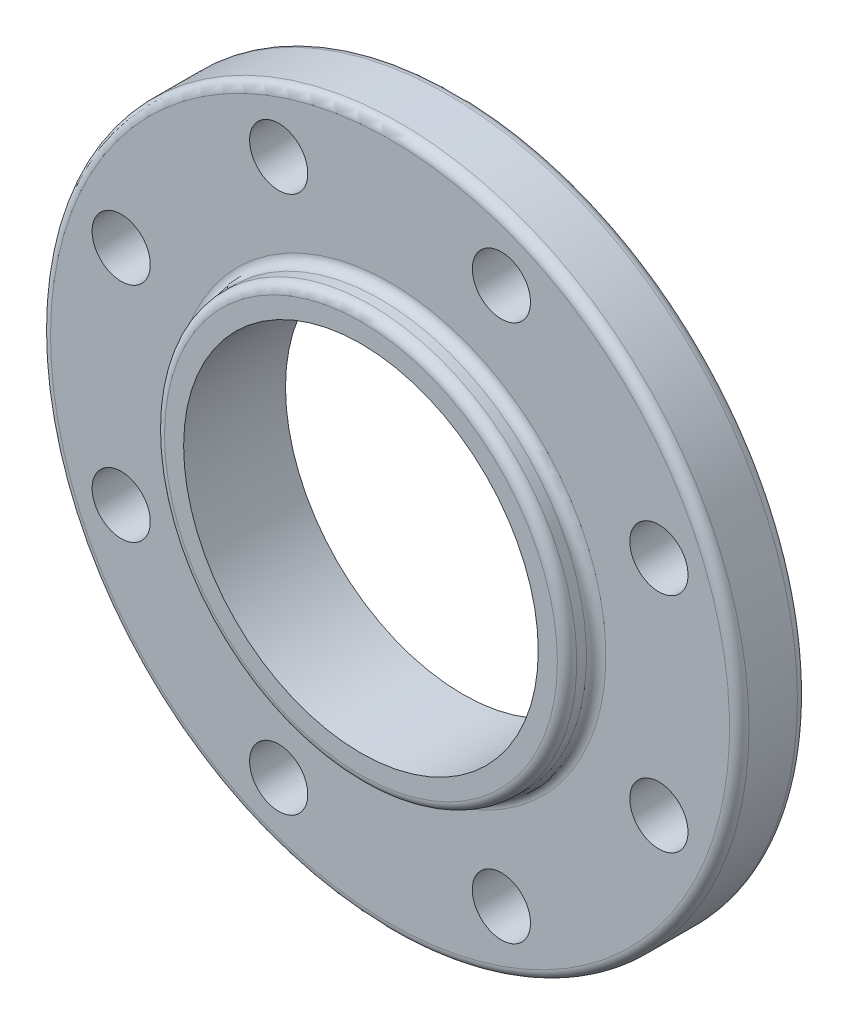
ISO-10303-21;
HEADER;
FILE_DESCRIPTION(('STEP AP214'),'2;1');
FILE_NAME('part.step','',(''),(''),'','','');
FILE_SCHEMA(('AUTOMOTIVE_DESIGN { 1 0 10303 214 1 1 1 1 }'));
ENDSEC;
DATA;
#1=APPLICATION_CONTEXT('core data for automotive mechanical design processes');
#2=APPLICATION_PROTOCOL_DEFINITION('international standard','automotive_design',2000,#1);
#3=PRODUCT_CONTEXT('',#1,'mechanical');
#4=PRODUCT('Part','Part','',(#3));
#5=PRODUCT_RELATED_PRODUCT_CATEGORY('part','',(#4));
#6=PRODUCT_DEFINITION_FORMATION('','',#4);
#7=PRODUCT_DEFINITION_CONTEXT('part definition',#1,'design');
#8=PRODUCT_DEFINITION('design','',#6,#7);
#9=PRODUCT_DEFINITION_SHAPE('','',#8);
#10=(LENGTH_UNIT() NAMED_UNIT(*) SI_UNIT(.MILLI.,.METRE.));
#11=(NAMED_UNIT(*) PLANE_ANGLE_UNIT() SI_UNIT($,.RADIAN.));
#12=(NAMED_UNIT(*) SI_UNIT($,.STERADIAN.) SOLID_ANGLE_UNIT());
#13=UNCERTAINTY_MEASURE_WITH_UNIT(LENGTH_MEASURE(1.E-05),#10,'distance_accuracy_value','');
#14=(GEOMETRIC_REPRESENTATION_CONTEXT(3) GLOBAL_UNCERTAINTY_ASSIGNED_CONTEXT((#13)) GLOBAL_UNIT_ASSIGNED_CONTEXT((#10,
#11,#12)) REPRESENTATION_CONTEXT('',''));
#15=CARTESIAN_POINT('',(0.,0.,0.));
#16=DIRECTION('',(0.,0.,1.));
#17=DIRECTION('',(1.,0.,0.));
#18=AXIS2_PLACEMENT_3D('',#15,#16,#17);
#19=CARTESIAN_POINT('',(58.0390000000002,1.38777878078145E-12,33.3375));
#20=DIRECTION('',(0.,0.,-1.));
#21=DIRECTION('',(-1.,0.,0.));
#22=AXIS2_PLACEMENT_3D('',#19,#20,#21);
#23=PLANE('',#22);
#24=CARTESIAN_POINT('',(0.,4.05231403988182E-12,33.3375));
#25=DIRECTION('',(0.,0.,-1.));
#26=DIRECTION('',(-1.,0.,0.));
#27=AXIS2_PLACEMENT_3D('',#24,#25,#26);
#28=CIRCLE('',#27,64.2937500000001);
#29=CARTESIAN_POINT('',(-64.2937500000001,3.92382931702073E-12,33.3375));
#30=VERTEX_POINT('',#29);
#31=EDGE_CURVE('E10',#30,#30,#28,.T.);
#32=ORIENTED_EDGE('',*,*,#31,.F.);
#33=EDGE_LOOP('',(#32));
#34=FACE_BOUND('',#33,.T.);
#35=CARTESIAN_POINT('',(0.,4.05231403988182E-12,33.3375));
#36=DIRECTION('',(0.,0.,-1.));
#37=DIRECTION('',(-1.,0.,0.));
#38=AXIS2_PLACEMENT_3D('',#35,#36,#37);
#39=CIRCLE('',#38,58.0390000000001);
#40=CARTESIAN_POINT('',(-58.0390000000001,3.93632881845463E-12,33.3375));
#41=VERTEX_POINT('',#40);
#42=EDGE_CURVE('E75',#41,#41,#39,.T.);
#43=ORIENTED_EDGE('',*,*,#42,.T.);
#44=EDGE_LOOP('',(#43));
#45=FACE_BOUND('',#44,.T.);
#46=ADVANCED_FACE('F32',(#34,#45),#23,.F.);
#47=CARTESIAN_POINT('',(0.,0.,30.1624999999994));
#48=DIRECTION('',(0.,0.,-1.));
#49=DIRECTION('',(-1.,0.,0.));
#50=AXIS2_PLACEMENT_3D('',#47,#48,#49);
#51=TOROIDAL_SURFACE('',#50,64.2937500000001,3.175);
#52=CARTESIAN_POINT('',(0.,0.,30.1624999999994));
#53=DIRECTION('',(0.,0.,-1.));
#54=DIRECTION('',(-1.,0.,0.));
#55=AXIS2_PLACEMENT_3D('',#52,#53,#54);
#56=CIRCLE('',#55,67.4687500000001);
#57=CARTESIAN_POINT('',(-67.4687500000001,0.,30.1624999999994));
#58=VERTEX_POINT('',#57);
#59=EDGE_CURVE('E38',#58,#58,#56,.T.);
#60=ORIENTED_EDGE('',*,*,#59,.F.);
#61=EDGE_LOOP('',(#60));
#62=FACE_BOUND('',#61,.T.);
#63=ORIENTED_EDGE('',*,*,#31,.T.);
#64=EDGE_LOOP('',(#63));
#65=FACE_BOUND('',#64,.T.);
#66=ADVANCED_FACE('F186',(#62,#65),#51,.T.);
#67=CARTESIAN_POINT('',(3.99680288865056E-12,0.,-94.0937313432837));
#68=DIRECTION('',(0.,0.,-1.));
#69=DIRECTION('',(-1.,0.,0.));
#70=AXIS2_PLACEMENT_3D('',#67,#68,#69);
#71=CYLINDRICAL_SURFACE('',#70,67.4687500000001);
#72=CARTESIAN_POINT('',(0.,0.,26.9875000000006));
#73=DIRECTION('',(0.,0.,-1.));
#74=DIRECTION('',(-1.,0.,0.));
#75=AXIS2_PLACEMENT_3D('',#72,#73,#74);
#76=CIRCLE('',#75,67.4687500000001);
#77=CARTESIAN_POINT('',(-67.4687500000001,0.,26.9875000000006));
#78=VERTEX_POINT('',#77);
#79=EDGE_CURVE('E42',#78,#78,#76,.T.);
#80=ORIENTED_EDGE('',*,*,#79,.F.);
#81=EDGE_LOOP('',(#80));
#82=FACE_BOUND('',#81,.T.);
#83=ORIENTED_EDGE('',*,*,#59,.T.);
#84=EDGE_LOOP('',(#83));
#85=FACE_BOUND('',#84,.T.);
#86=ADVANCED_FACE('F181',(#82,#85),#71,.T.);
#87=CARTESIAN_POINT('',(0.,0.,26.9875000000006));
#88=DIRECTION('',(0.,0.,-1.));
#89=DIRECTION('',(-1.,0.,0.));
#90=AXIS2_PLACEMENT_3D('',#87,#88,#89);
#91=TOROIDAL_SURFACE('',#90,70.6437500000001,3.17500000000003);
#92=CARTESIAN_POINT('',(0.,0.,23.8125));
#93=DIRECTION('',(0.,0.,-1.));
#94=DIRECTION('',(-1.,0.,0.));
#95=AXIS2_PLACEMENT_3D('',#92,#93,#94);
#96=CIRCLE('',#95,70.6437500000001);
#97=CARTESIAN_POINT('',(-70.6437500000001,0.,23.8125));
#98=VERTEX_POINT('',#97);
#99=EDGE_CURVE('E46',#98,#98,#96,.T.);
#100=ORIENTED_EDGE('',*,*,#99,.F.);
#101=EDGE_LOOP('',(#100));
#102=FACE_BOUND('',#101,.T.);
#103=ORIENTED_EDGE('',*,*,#79,.T.);
#104=EDGE_LOOP('',(#103));
#105=FACE_BOUND('',#104,.T.);
#106=ADVANCED_FACE('F174',(#102,#105),#91,.F.);
#107=CARTESIAN_POINT('',(111.125,0.,23.8125));
#108=DIRECTION('',(0.,0.,-1.));
#109=DIRECTION('',(-1.,0.,0.));
#110=AXIS2_PLACEMENT_3D('',#107,#108,#109);
#111=PLANE('',#110);
#112=CARTESIAN_POINT('',(36.4505969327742,87.9995254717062,23.8125));
#113=DIRECTION('',(0.,0.,-1.));
#114=DIRECTION('',(-1.,0.,0.));
#115=AXIS2_PLACEMENT_3D('',#112,#113,#114);
#116=CIRCLE('',#115,9.525);
#117=CARTESIAN_POINT('',(26.9255969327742,87.9995254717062,23.8125));
#118=VERTEX_POINT('',#117);
#119=EDGE_CURVE('E120',#118,#118,#116,.T.);
#120=ORIENTED_EDGE('',*,*,#119,.T.);
#121=EDGE_LOOP('',(#120));
#122=FACE_BOUND('',#121,.T.);
#123=CARTESIAN_POINT('',(87.9995254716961,36.4505969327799,23.8125));
#124=DIRECTION('',(0.,0.,-1.));
#125=DIRECTION('',(-1.,0.,0.));
#126=AXIS2_PLACEMENT_3D('',#123,#124,#125);
#127=CIRCLE('',#126,9.525);
#128=CARTESIAN_POINT('',(78.4745254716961,36.4505969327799,23.8125));
#129=VERTEX_POINT('',#128);
#130=EDGE_CURVE('E114',#129,#129,#127,.T.);
#131=ORIENTED_EDGE('',*,*,#130,.T.);
#132=EDGE_LOOP('',(#131));
#133=FACE_BOUND('',#132,.T.);
#134=CARTESIAN_POINT('',(87.9995254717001,-36.4505969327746,23.8125));
#135=DIRECTION('',(0.,0.,-1.));
#136=DIRECTION('',(-1.,0.,0.));
#137=AXIS2_PLACEMENT_3D('',#134,#135,#136);
#138=CIRCLE('',#137,9.525);
#139=CARTESIAN_POINT('',(78.4745254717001,-36.4505969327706,23.8125));
#140=VERTEX_POINT('',#139);
#141=EDGE_CURVE('E108',#140,#140,#138,.T.);
#142=ORIENTED_EDGE('',*,*,#141,.T.);
#143=EDGE_LOOP('',(#142));
#144=FACE_BOUND('',#143,.T.);
#145=CARTESIAN_POINT('',(36.4505969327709,-87.9995254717,23.8125));
#146=DIRECTION('',(0.,0.,-1.));
#147=DIRECTION('',(-1.,0.,0.));
#148=AXIS2_PLACEMENT_3D('',#145,#146,#147);
#149=CIRCLE('',#148,9.525);
#150=CARTESIAN_POINT('',(26.9255969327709,-87.999525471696,23.8125));
#151=VERTEX_POINT('',#150);
#152=EDGE_CURVE('E102',#151,#151,#149,.T.);
#153=ORIENTED_EDGE('',*,*,#152,.T.);
#154=EDGE_LOOP('',(#153));
#155=FACE_BOUND('',#154,.T.);
#156=CARTESIAN_POINT('',(-36.4505969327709,-87.9995254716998,23.8125));
#157=DIRECTION('',(0.,0.,-1.));
#158=DIRECTION('',(-1.,0.,0.));
#159=AXIS2_PLACEMENT_3D('',#156,#157,#158);
#160=CIRCLE('',#159,9.525);
#161=CARTESIAN_POINT('',(-45.9755969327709,-87.9995254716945,23.8125));
#162=VERTEX_POINT('',#161);
#163=EDGE_CURVE('E96',#162,#162,#160,.T.);
#164=ORIENTED_EDGE('',*,*,#163,.T.);
#165=EDGE_LOOP('',(#164));
#166=FACE_BOUND('',#165,.T.);
#167=CARTESIAN_POINT('',(-87.9995254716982,-36.4505969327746,23.8125));
#168=DIRECTION('',(0.,0.,-1.));
#169=DIRECTION('',(-1.,0.,0.));
#170=AXIS2_PLACEMENT_3D('',#167,#168,#169);
#171=CIRCLE('',#170,9.525);
#172=CARTESIAN_POINT('',(-97.5245254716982,-36.4505969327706,23.8125));
#173=VERTEX_POINT('',#172);
#174=EDGE_CURVE('E90',#173,#173,#171,.T.);
#175=ORIENTED_EDGE('',*,*,#174,.T.);
#176=EDGE_LOOP('',(#175));
#177=FACE_BOUND('',#176,.T.);
#178=CARTESIAN_POINT('',(-87.999525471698,36.4505969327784,23.8125));
#179=DIRECTION('',(0.,0.,-1.));
#180=DIRECTION('',(-1.,0.,0.));
#181=AXIS2_PLACEMENT_3D('',#178,#179,#180);
#182=CIRCLE('',#181,9.525);
#183=CARTESIAN_POINT('',(-97.524525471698,36.4505969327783,23.8125));
#184=VERTEX_POINT('',#183);
#185=EDGE_CURVE('E84',#184,#184,#182,.T.);
#186=ORIENTED_EDGE('',*,*,#185,.T.);
#187=EDGE_LOOP('',(#186));
#188=FACE_BOUND('',#187,.T.);
#189=CARTESIAN_POINT('',(-36.4505969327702,87.9995254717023,23.8125));
#190=DIRECTION('',(0.,0.,-1.));
#191=DIRECTION('',(-1.,0.,0.));
#192=AXIS2_PLACEMENT_3D('',#189,#190,#191);
#193=CIRCLE('',#192,9.525);
#194=CARTESIAN_POINT('',(-45.9755969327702,87.9995254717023,23.8125));
#195=VERTEX_POINT('',#194);
#196=EDGE_CURVE('E78',#195,#195,#193,.T.);
#197=ORIENTED_EDGE('',*,*,#196,.T.);
#198=EDGE_LOOP('',(#197));
#199=FACE_BOUND('',#198,.T.);
#200=CARTESIAN_POINT('',(0.,0.,23.8125));
#201=DIRECTION('',(0.,0.,-1.));
#202=DIRECTION('',(-1.,0.,0.));
#203=AXIS2_PLACEMENT_3D('',#200,#201,#202);
#204=CIRCLE('',#203,111.125);
#205=CARTESIAN_POINT('',(-111.125,-1.66561209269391E-13,23.8125));
#206=VERTEX_POINT('',#205);
#207=EDGE_CURVE('E51',#206,#206,#204,.T.);
#208=ORIENTED_EDGE('',*,*,#207,.F.);
#209=EDGE_LOOP('',(#208));
#210=FACE_BOUND('',#209,.T.);
#211=ORIENTED_EDGE('',*,*,#99,.T.);
#212=EDGE_LOOP('',(#211));
#213=FACE_BOUND('',#212,.T.);
#214=ADVANCED_FACE('F168',(#122,#133,#144,#155,#166,#177,#188,#199,#210,#213),#111,.F.);
#215=CARTESIAN_POINT('',(0.,0.,20.6374999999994));
#216=DIRECTION('',(0.,0.,-1.));
#217=DIRECTION('',(-1.,0.,0.));
#218=AXIS2_PLACEMENT_3D('',#215,#216,#217);
#219=TOROIDAL_SURFACE('',#218,111.125,3.175);
#220=CARTESIAN_POINT('',(0.,0.,20.6374999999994));
#221=DIRECTION('',(0.,0.,-1.));
#222=DIRECTION('',(-1.,0.,0.));
#223=AXIS2_PLACEMENT_3D('',#220,#221,#222);
#224=CIRCLE('',#223,114.3);
#225=CARTESIAN_POINT('',(-114.3,-1.72906133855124E-13,20.6374999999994));
#226=VERTEX_POINT('',#225);
#227=EDGE_CURVE('E54',#226,#226,#224,.T.);
#228=ORIENTED_EDGE('',*,*,#227,.F.);
#229=EDGE_LOOP('',(#228));
#230=FACE_BOUND('',#229,.T.);
#231=ORIENTED_EDGE('',*,*,#207,.T.);
#232=EDGE_LOOP('',(#231));
#233=FACE_BOUND('',#232,.T.);
#234=ADVANCED_FACE('F162',(#230,#233),#219,.T.);
#235=CARTESIAN_POINT('',(3.99680288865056E-12,0.,-94.0937313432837));
#236=DIRECTION('',(0.,0.,-1.));
#237=DIRECTION('',(-1.,0.,0.));
#238=AXIS2_PLACEMENT_3D('',#235,#236,#237);
#239=CYLINDRICAL_SURFACE('',#238,114.3);
#240=CARTESIAN_POINT('',(0.,0.,4.7625));
#241=DIRECTION('',(0.,0.,-1.));
#242=DIRECTION('',(-1.,0.,0.));
#243=AXIS2_PLACEMENT_3D('',#240,#241,#242);
#244=CIRCLE('',#243,114.3);
#245=CARTESIAN_POINT('',(-114.3,-1.72906133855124E-13,4.7625));
#246=VERTEX_POINT('',#245);
#247=EDGE_CURVE('E57',#246,#246,#244,.T.);
#248=ORIENTED_EDGE('',*,*,#247,.F.);
#249=EDGE_LOOP('',(#248));
#250=FACE_BOUND('',#249,.T.);
#251=ORIENTED_EDGE('',*,*,#227,.T.);
#252=EDGE_LOOP('',(#251));
#253=FACE_BOUND('',#252,.T.);
#254=ADVANCED_FACE('F156',(#250,#253),#239,.T.);
#255=CARTESIAN_POINT('',(0.,0.,4.7625));
#256=DIRECTION('',(0.,0.,-1.));
#257=DIRECTION('',(-1.,0.,0.));
#258=AXIS2_PLACEMENT_3D('',#255,#256,#257);
#259=TOROIDAL_SURFACE('',#258,111.125,3.17499999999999);
#260=CARTESIAN_POINT('',(0.,0.,1.58749999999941));
#261=DIRECTION('',(0.,0.,-1.));
#262=DIRECTION('',(-1.,0.,0.));
#263=AXIS2_PLACEMENT_3D('',#260,#261,#262);
#264=CIRCLE('',#263,111.125);
#265=CARTESIAN_POINT('',(-111.125,-1.66561209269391E-13,1.58749999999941));
#266=VERTEX_POINT('',#265);
#267=EDGE_CURVE('E60',#266,#266,#264,.T.);
#268=ORIENTED_EDGE('',*,*,#267,.F.);
#269=EDGE_LOOP('',(#268));
#270=FACE_BOUND('',#269,.T.);
#271=ORIENTED_EDGE('',*,*,#247,.T.);
#272=EDGE_LOOP('',(#271));
#273=FACE_BOUND('',#272,.T.);
#274=ADVANCED_FACE('F134',(#270,#273),#259,.T.);
#275=CARTESIAN_POINT('',(80.1052499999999,1.38777878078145E-12,1.58749999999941));
#276=DIRECTION('',(0.,0.,1.));
#277=DIRECTION('',(1.,0.,0.));
#278=AXIS2_PLACEMENT_3D('',#275,#276,#277);
#279=PLANE('',#278);
#280=CARTESIAN_POINT('',(36.4505969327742,87.9995254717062,1.58749999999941));
#281=DIRECTION('',(0.,0.,-1.));
#282=DIRECTION('',(-0.707106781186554,0.707106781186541,0.));
#283=AXIS2_PLACEMENT_3D('',#280,#281,#282);
#284=CIRCLE('',#283,9.525);
#285=CARTESIAN_POINT('',(26.9255969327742,87.9995254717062,1.5874999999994));
#286=VERTEX_POINT('',#285);
#287=EDGE_CURVE('E123',#286,#286,#284,.T.);
#288=ORIENTED_EDGE('',*,*,#287,.F.);
#289=EDGE_LOOP('',(#288));
#290=FACE_BOUND('',#289,.T.);
#291=CARTESIAN_POINT('',(87.9995254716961,36.4505969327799,1.58749999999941));
#292=DIRECTION('',(0.,0.,-1.));
#293=DIRECTION('',(0.,1.00000000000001,0.));
#294=AXIS2_PLACEMENT_3D('',#291,#292,#293);
#295=CIRCLE('',#294,9.525);
#296=CARTESIAN_POINT('',(78.4745254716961,36.4505969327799,1.5874999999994));
#297=VERTEX_POINT('',#296);
#298=EDGE_CURVE('E117',#297,#297,#295,.T.);
#299=ORIENTED_EDGE('',*,*,#298,.F.);
#300=EDGE_LOOP('',(#299));
#301=FACE_BOUND('',#300,.T.);
#302=CARTESIAN_POINT('',(87.9995254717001,-36.4505969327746,1.58749999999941));
#303=DIRECTION('',(0.,0.,-1.));
#304=DIRECTION('',(0.707106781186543,0.70710678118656,0.));
#305=AXIS2_PLACEMENT_3D('',#302,#303,#304);
#306=CIRCLE('',#305,9.525);
#307=CARTESIAN_POINT('',(78.4745254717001,-36.4505969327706,1.5874999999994));
#308=VERTEX_POINT('',#307);
#309=EDGE_CURVE('E111',#308,#308,#306,.T.);
#310=ORIENTED_EDGE('',*,*,#309,.F.);
#311=EDGE_LOOP('',(#310));
#312=FACE_BOUND('',#311,.T.);
#313=CARTESIAN_POINT('',(36.4505969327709,-87.9995254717,1.58749999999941));
#314=DIRECTION('',(0.,0.,-1.));
#315=DIRECTION('',(1.,0.,0.));
#316=AXIS2_PLACEMENT_3D('',#313,#314,#315);
#317=CIRCLE('',#316,9.525);
#318=CARTESIAN_POINT('',(26.9255969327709,-87.999525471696,1.5874999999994));
#319=VERTEX_POINT('',#318);
#320=EDGE_CURVE('E105',#319,#319,#317,.T.);
#321=ORIENTED_EDGE('',*,*,#320,.F.);
#322=EDGE_LOOP('',(#321));
#323=FACE_BOUND('',#322,.T.);
#324=CARTESIAN_POINT('',(-36.4505969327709,-87.9995254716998,1.58749999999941));
#325=DIRECTION('',(0.,0.,-1.));
#326=DIRECTION('',(0.707106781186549,-0.707106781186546,0.));
#327=AXIS2_PLACEMENT_3D('',#324,#325,#326);
#328=CIRCLE('',#327,9.525);
#329=CARTESIAN_POINT('',(-45.9755969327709,-87.9995254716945,1.5874999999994));
#330=VERTEX_POINT('',#329);
#331=EDGE_CURVE('E99',#330,#330,#328,.T.);
#332=ORIENTED_EDGE('',*,*,#331,.F.);
#333=EDGE_LOOP('',(#332));
#334=FACE_BOUND('',#333,.T.);
#335=CARTESIAN_POINT('',(-87.9995254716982,-36.4505969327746,1.58749999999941));
#336=DIRECTION('',(0.,0.,-1.));
#337=DIRECTION('',(0.,-1.00000000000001,0.));
#338=AXIS2_PLACEMENT_3D('',#335,#336,#337);
#339=CIRCLE('',#338,9.525);
#340=CARTESIAN_POINT('',(-97.5245254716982,-36.4505969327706,1.5874999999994));
#341=VERTEX_POINT('',#340);
#342=EDGE_CURVE('E93',#341,#341,#339,.T.);
#343=ORIENTED_EDGE('',*,*,#342,.F.);
#344=EDGE_LOOP('',(#343));
#345=FACE_BOUND('',#344,.T.);
#346=CARTESIAN_POINT('',(-87.999525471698,36.4505969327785,1.58749999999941));
#347=DIRECTION('',(0.,0.,-1.));
#348=DIRECTION('',(-0.707106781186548,-0.707106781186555,0.));
#349=AXIS2_PLACEMENT_3D('',#346,#347,#348);
#350=CIRCLE('',#349,9.525);
#351=CARTESIAN_POINT('',(-97.524525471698,36.4505969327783,1.5874999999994));
#352=VERTEX_POINT('',#351);
#353=EDGE_CURVE('E87',#352,#352,#350,.T.);
#354=ORIENTED_EDGE('',*,*,#353,.F.);
#355=EDGE_LOOP('',(#354));
#356=FACE_BOUND('',#355,.T.);
#357=CARTESIAN_POINT('',(-36.4505969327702,87.9995254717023,1.58749999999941));
#358=DIRECTION('',(0.,0.,-1.));
#359=DIRECTION('',(-1.,0.,0.));
#360=AXIS2_PLACEMENT_3D('',#357,#358,#359);
#361=CIRCLE('',#360,9.525);
#362=CARTESIAN_POINT('',(-45.9755969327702,87.9995254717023,1.5874999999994));
#363=VERTEX_POINT('',#362);
#364=EDGE_CURVE('E81',#363,#363,#361,.T.);
#365=ORIENTED_EDGE('',*,*,#364,.F.);
#366=EDGE_LOOP('',(#365));
#367=FACE_BOUND('',#366,.T.);
#368=CARTESIAN_POINT('',(0.,0.,1.58749999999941));
#369=DIRECTION('',(0.,0.,-1.));
#370=DIRECTION('',(-1.,0.,0.));
#371=AXIS2_PLACEMENT_3D('',#368,#369,#370);
#372=CIRCLE('',#371,80.10525);
#373=CARTESIAN_POINT('',(-80.10525,-1.04571296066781E-13,1.58749999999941));
#374=VERTEX_POINT('',#373);
#375=EDGE_CURVE('E63',#374,#374,#372,.T.);
#376=ORIENTED_EDGE('',*,*,#375,.F.);
#377=EDGE_LOOP('',(#376));
#378=FACE_BOUND('',#377,.T.);
#379=ORIENTED_EDGE('',*,*,#267,.T.);
#380=EDGE_LOOP('',(#379));
#381=FACE_BOUND('',#380,.T.);
#382=ADVANCED_FACE('F130',(#290,#301,#312,#323,#334,#345,#356,#367,#378,#381),#279,.F.);
#383=CARTESIAN_POINT('',(0.,0.,0.06349999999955));
#384=DIRECTION('',(0.,0.,-1.));
#385=DIRECTION('',(-1.,0.,0.));
#386=AXIS2_PLACEMENT_3D('',#383,#384,#385);
#387=TOROIDAL_SURFACE('',#386,80.10525,1.52400000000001);
#388=CARTESIAN_POINT('',(0.,0.,0.06349999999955));
#389=DIRECTION('',(0.,0.,-1.));
#390=DIRECTION('',(-1.,0.,0.));
#391=AXIS2_PLACEMENT_3D('',#388,#389,#390);
#392=CIRCLE('',#391,78.58125);
#393=CARTESIAN_POINT('',(-78.58125,-1.57036883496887E-13,0.06349999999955));
#394=VERTEX_POINT('',#393);
#395=EDGE_CURVE('E66',#394,#394,#392,.T.);
#396=ORIENTED_EDGE('',*,*,#395,.F.);
#397=EDGE_LOOP('',(#396));
#398=FACE_BOUND('',#397,.T.);
#399=ORIENTED_EDGE('',*,*,#375,.T.);
#400=EDGE_LOOP('',(#399));
#401=FACE_BOUND('',#400,.T.);
#402=ADVANCED_FACE('F133',(#398,#401),#387,.F.);
#403=CARTESIAN_POINT('',(3.99680288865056E-12,0.,-94.0937313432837));
#404=DIRECTION('',(0.,0.,-1.));
#405=DIRECTION('',(-1.,0.,0.));
#406=AXIS2_PLACEMENT_3D('',#403,#404,#405);
#407=CYLINDRICAL_SURFACE('',#406,78.58125);
#408=CARTESIAN_POINT('',(0.,0.,0.));
#409=DIRECTION('',(0.,0.,-1.));
#410=DIRECTION('',(-1.,0.,0.));
#411=AXIS2_PLACEMENT_3D('',#408,#409,#410);
#412=CIRCLE('',#411,78.58125);
#413=CARTESIAN_POINT('',(-78.58125,-1.57036883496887E-13,0.));
#414=VERTEX_POINT('',#413);
#415=EDGE_CURVE('E69',#414,#414,#412,.T.);
#416=ORIENTED_EDGE('',*,*,#415,.F.);
#417=EDGE_LOOP('',(#416));
#418=FACE_BOUND('',#417,.T.);
#419=ORIENTED_EDGE('',*,*,#395,.T.);
#420=EDGE_LOOP('',(#419));
#421=FACE_BOUND('',#420,.T.);
#422=ADVANCED_FACE('F209',(#418,#421),#407,.T.);
#423=CARTESIAN_POINT('',(58.039,-3.99680288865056E-12,0.));
#424=DIRECTION('',(0.,0.,1.));
#425=DIRECTION('',(1.,0.,0.));
#426=AXIS2_PLACEMENT_3D('',#423,#424,#425);
#427=PLANE('',#426);
#428=CARTESIAN_POINT('',(0.,0.,0.));
#429=DIRECTION('',(0.,0.,-1.));
#430=DIRECTION('',(-1.,0.,0.));
#431=AXIS2_PLACEMENT_3D('',#428,#429,#430);
#432=CIRCLE('',#431,58.0390000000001);
#433=CARTESIAN_POINT('',(-58.0390000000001,-1.15985221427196E-13,0.));
#434=VERTEX_POINT('',#433);
#435=EDGE_CURVE('E72',#434,#434,#432,.T.);
#436=ORIENTED_EDGE('',*,*,#435,.F.);
#437=EDGE_LOOP('',(#436));
#438=FACE_BOUND('',#437,.T.);
#439=ORIENTED_EDGE('',*,*,#415,.T.);
#440=EDGE_LOOP('',(#439));
#441=FACE_BOUND('',#440,.T.);
#442=ADVANCED_FACE('F203',(#438,#441),#427,.F.);
#443=CARTESIAN_POINT('',(3.99680288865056E-12,0.,-94.0937313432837));
#444=DIRECTION('',(0.,0.,-1.));
#445=DIRECTION('',(-1.,0.,0.));
#446=AXIS2_PLACEMENT_3D('',#443,#444,#445);
#447=CYLINDRICAL_SURFACE('',#446,58.0390000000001);
#448=ORIENTED_EDGE('',*,*,#42,.F.);
#449=EDGE_LOOP('',(#448));
#450=FACE_BOUND('',#449,.T.);
#451=ORIENTED_EDGE('',*,*,#435,.T.);
#452=EDGE_LOOP('',(#451));
#453=FACE_BOUND('',#452,.T.);
#454=ADVANCED_FACE('F199',(#450,#453),#447,.F.);
#455=CARTESIAN_POINT('',(-36.4505969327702,87.9995254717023,33.3375));
#456=DIRECTION('',(0.,0.,-1.));
#457=DIRECTION('',(-1.,0.,0.));
#458=AXIS2_PLACEMENT_3D('',#455,#456,#457);
#459=CYLINDRICAL_SURFACE('',#458,9.525);
#460=CARTESIAN_POINT('',(-45.9755969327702,87.9995254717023,1.5874999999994));
#461=CARTESIAN_POINT('',(-45.9755969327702,87.9995254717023,1.81901041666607));
#462=CARTESIAN_POINT('',(-45.9755969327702,87.9995254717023,2.05052083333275));
#463=CARTESIAN_POINT('',(-45.9755969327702,87.9995254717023,2.51354166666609));
#464=CARTESIAN_POINT('',(-45.9755969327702,87.9995254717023,2.74505208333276));
#465=CARTESIAN_POINT('',(-45.9755969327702,87.9995254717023,3.20807291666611));
#466=CARTESIAN_POINT('',(-45.9755969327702,87.9995254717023,3.43958333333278));
#467=CARTESIAN_POINT('',(-45.9755969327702,87.9995254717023,3.90260416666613));
#468=CARTESIAN_POINT('',(-45.9755969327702,87.9995254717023,4.1341145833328));
#469=CARTESIAN_POINT('',(-45.9755969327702,87.9995254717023,4.59713541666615));
#470=CARTESIAN_POINT('',(-45.9755969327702,87.9995254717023,4.82864583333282));
#471=CARTESIAN_POINT('',(-45.9755969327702,87.9995254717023,5.29166666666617));
#472=CARTESIAN_POINT('',(-45.9755969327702,87.9995254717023,5.52317708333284));
#473=CARTESIAN_POINT('',(-45.9755969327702,87.9995254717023,5.98619791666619));
#474=CARTESIAN_POINT('',(-45.9755969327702,87.9995254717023,6.21770833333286));
#475=CARTESIAN_POINT('',(-45.9755969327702,87.9995254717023,6.68072916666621));
#476=CARTESIAN_POINT('',(-45.9755969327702,87.9995254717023,6.91223958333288));
#477=CARTESIAN_POINT('',(-45.9755969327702,87.9995254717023,7.37526041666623));
#478=CARTESIAN_POINT('',(-45.9755969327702,87.9995254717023,7.6067708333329));
#479=CARTESIAN_POINT('',(-45.9755969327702,87.9995254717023,8.06979166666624));
#480=CARTESIAN_POINT('',(-45.9755969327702,87.9995254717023,8.30130208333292));
#481=CARTESIAN_POINT('',(-45.9755969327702,87.9995254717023,8.76432291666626));
#482=CARTESIAN_POINT('',(-45.9755969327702,87.9995254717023,8.99583333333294));
#483=CARTESIAN_POINT('',(-45.9755969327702,87.9995254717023,9.45885416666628));
#484=CARTESIAN_POINT('',(-45.9755969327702,87.9995254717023,9.69036458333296));
#485=CARTESIAN_POINT('',(-45.9755969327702,87.9995254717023,10.1533854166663));
#486=CARTESIAN_POINT('',(-45.9755969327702,87.9995254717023,10.384895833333));
#487=CARTESIAN_POINT('',(-45.9755969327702,87.9995254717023,10.8479166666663));
#488=CARTESIAN_POINT('',(-45.9755969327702,87.9995254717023,11.079427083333));
#489=CARTESIAN_POINT('',(-45.9755969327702,87.9995254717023,11.5424479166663));
#490=CARTESIAN_POINT('',(-45.9755969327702,87.9995254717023,11.773958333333));
#491=CARTESIAN_POINT('',(-45.9755969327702,87.9995254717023,12.2369791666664));
#492=CARTESIAN_POINT('',(-45.9755969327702,87.9995254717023,12.468489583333));
#493=CARTESIAN_POINT('',(-45.9755969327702,87.9995254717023,12.9315104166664));
#494=CARTESIAN_POINT('',(-45.9755969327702,87.9995254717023,13.1630208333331));
#495=CARTESIAN_POINT('',(-45.9755969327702,87.9995254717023,13.6260416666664));
#496=CARTESIAN_POINT('',(-45.9755969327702,87.9995254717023,13.8575520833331));
#497=CARTESIAN_POINT('',(-45.9755969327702,87.9995254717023,14.3205729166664));
#498=CARTESIAN_POINT('',(-45.9755969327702,87.9995254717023,14.5520833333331));
#499=CARTESIAN_POINT('',(-45.9755969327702,87.9995254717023,15.0151041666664));
#500=CARTESIAN_POINT('',(-45.9755969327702,87.9995254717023,15.2466145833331));
#501=CARTESIAN_POINT('',(-45.9755969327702,87.9995254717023,15.7096354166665));
#502=CARTESIAN_POINT('',(-45.9755969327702,87.9995254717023,15.9411458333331));
#503=CARTESIAN_POINT('',(-45.9755969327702,87.9995254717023,16.4041666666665));
#504=CARTESIAN_POINT('',(-45.9755969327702,87.9995254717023,16.6356770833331));
#505=CARTESIAN_POINT('',(-45.9755969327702,87.9995254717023,17.0986979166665));
#506=CARTESIAN_POINT('',(-45.9755969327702,87.9995254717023,17.3302083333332));
#507=CARTESIAN_POINT('',(-45.9755969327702,87.9995254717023,17.7932291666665));
#508=CARTESIAN_POINT('',(-45.9755969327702,87.9995254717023,18.0247395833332));
#509=CARTESIAN_POINT('',(-45.9755969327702,87.9995254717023,18.4877604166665));
#510=CARTESIAN_POINT('',(-45.9755969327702,87.9995254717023,18.7192708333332));
#511=CARTESIAN_POINT('',(-45.9755969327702,87.9995254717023,19.1822916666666));
#512=CARTESIAN_POINT('',(-45.9755969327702,87.9995254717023,19.4138020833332));
#513=CARTESIAN_POINT('',(-45.9755969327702,87.9995254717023,19.8768229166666));
#514=CARTESIAN_POINT('',(-45.9755969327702,87.9995254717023,20.1083333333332));
#515=CARTESIAN_POINT('',(-45.9755969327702,87.9995254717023,20.5713541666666));
#516=CARTESIAN_POINT('',(-45.9755969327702,87.9995254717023,20.8028645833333));
#517=CARTESIAN_POINT('',(-45.9755969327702,87.9995254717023,21.2658854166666));
#518=CARTESIAN_POINT('',(-45.9755969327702,87.9995254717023,21.4973958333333));
#519=CARTESIAN_POINT('',(-45.9755969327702,87.9995254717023,21.9604166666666));
#520=CARTESIAN_POINT('',(-45.9755969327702,87.9995254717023,22.1919270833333));
#521=CARTESIAN_POINT('',(-45.9755969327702,87.9995254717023,22.6549479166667));
#522=CARTESIAN_POINT('',(-45.9755969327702,87.9995254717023,22.8864583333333));
#523=CARTESIAN_POINT('',(-45.9755969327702,87.9995254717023,23.3494791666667));
#524=CARTESIAN_POINT('',(-45.9755969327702,87.9995254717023,23.5809895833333));
#525=CARTESIAN_POINT('',(-45.9755969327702,87.9995254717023,23.8125));
#526=B_SPLINE_CURVE_WITH_KNOTS('',3,(#460,#461,#462,#463,#464,#465,#466,#467,#468,#469,#470,
#471,#472,#473,#474,#475,#476,#477,#478,#479,#480,#481,#482,#483,#484,#485,#486,#487,#488,#489,
#490,#491,#492,#493,#494,#495,#496,#497,#498,#499,#500,#501,#502,#503,#504,#505,#506,#507,#508,
#509,#510,#511,#512,#513,#514,#515,#516,#517,#518,#519,#520,#521,#522,#523,#524,#525),
.UNSPECIFIED.,.F.,.F.,(4,2,2,2,2,2,2,2,2,2,2,2,2,2,2,2,2,2,2,2,2,2,2,2,2,2,2,2,2,2,2,2,4),(0.,
0.694531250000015,1.38906250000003,2.08359375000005,2.77812500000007,3.47265625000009,
4.16718750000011,4.86171875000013,5.55625000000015,6.25078125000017,6.94531250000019,
7.63984375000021,8.33437500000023,9.02890625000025,9.72343750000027,10.4179687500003,
11.1125000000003,11.8070312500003,12.5015625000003,13.1960937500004,13.8906250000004,
14.5851562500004,15.2796875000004,15.9742187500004,16.6687500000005,17.3632812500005,
18.0578125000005,18.7523437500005,19.4468750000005,20.1414062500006,20.8359375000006,
21.5304687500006,22.2250000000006),.UNSPECIFIED.);
#527=EDGE_CURVE('BSEAM202',#363,#195,#526,.T.);
#528=ORIENTED_EDGE('',*,*,#364,.T.);
#529=ORIENTED_EDGE('',*,*,#196,.F.);
#530=ORIENTED_EDGE('',*,*,#527,.T.);
#531=ORIENTED_EDGE('',*,*,#527,.F.);
#532=EDGE_LOOP('',(#528,#530,#529,#531));
#533=FACE_BOUND('',#532,.T.);
#534=ADVANCED_FACE('F202',(#533),#459,.F.);
#535=CARTESIAN_POINT('',(-87.999525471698,36.4505969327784,33.3375));
#536=DIRECTION('',(0.,0.,-1.));
#537=DIRECTION('',(-1.,0.,0.));
#538=AXIS2_PLACEMENT_3D('',#535,#536,#537);
#539=CYLINDRICAL_SURFACE('',#538,9.525);
#540=CARTESIAN_POINT('',(-97.524525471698,36.4505969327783,1.5874999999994));
#541=CARTESIAN_POINT('',(-97.524525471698,36.4505969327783,1.81901041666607));
#542=CARTESIAN_POINT('',(-97.524525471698,36.4505969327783,2.05052083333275));
#543=CARTESIAN_POINT('',(-97.524525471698,36.4505969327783,2.51354166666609));
#544=CARTESIAN_POINT('',(-97.524525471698,36.4505969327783,2.74505208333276));
#545=CARTESIAN_POINT('',(-97.524525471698,36.4505969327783,3.20807291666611));
#546=CARTESIAN_POINT('',(-97.524525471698,36.4505969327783,3.43958333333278));
#547=CARTESIAN_POINT('',(-97.524525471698,36.4505969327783,3.90260416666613));
#548=CARTESIAN_POINT('',(-97.524525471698,36.4505969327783,4.1341145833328));
#549=CARTESIAN_POINT('',(-97.524525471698,36.4505969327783,4.59713541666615));
#550=CARTESIAN_POINT('',(-97.524525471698,36.4505969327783,4.82864583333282));
#551=CARTESIAN_POINT('',(-97.524525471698,36.4505969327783,5.29166666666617));
#552=CARTESIAN_POINT('',(-97.524525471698,36.4505969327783,5.52317708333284));
#553=CARTESIAN_POINT('',(-97.524525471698,36.4505969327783,5.98619791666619));
#554=CARTESIAN_POINT('',(-97.524525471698,36.4505969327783,6.21770833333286));
#555=CARTESIAN_POINT('',(-97.524525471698,36.4505969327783,6.68072916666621));
#556=CARTESIAN_POINT('',(-97.524525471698,36.4505969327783,6.91223958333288));
#557=CARTESIAN_POINT('',(-97.524525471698,36.4505969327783,7.37526041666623));
#558=CARTESIAN_POINT('',(-97.524525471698,36.4505969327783,7.6067708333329));
#559=CARTESIAN_POINT('',(-97.524525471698,36.4505969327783,8.06979166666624));
#560=CARTESIAN_POINT('',(-97.524525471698,36.4505969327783,8.30130208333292));
#561=CARTESIAN_POINT('',(-97.524525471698,36.4505969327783,8.76432291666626));
#562=CARTESIAN_POINT('',(-97.524525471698,36.4505969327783,8.99583333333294));
#563=CARTESIAN_POINT('',(-97.524525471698,36.4505969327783,9.45885416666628));
#564=CARTESIAN_POINT('',(-97.524525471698,36.4505969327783,9.69036458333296));
#565=CARTESIAN_POINT('',(-97.524525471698,36.4505969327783,10.1533854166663));
#566=CARTESIAN_POINT('',(-97.524525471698,36.4505969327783,10.384895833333));
#567=CARTESIAN_POINT('',(-97.524525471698,36.4505969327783,10.8479166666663));
#568=CARTESIAN_POINT('',(-97.524525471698,36.4505969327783,11.079427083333));
#569=CARTESIAN_POINT('',(-97.524525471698,36.4505969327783,11.5424479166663));
#570=CARTESIAN_POINT('',(-97.524525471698,36.4505969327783,11.773958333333));
#571=CARTESIAN_POINT('',(-97.524525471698,36.4505969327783,12.2369791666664));
#572=CARTESIAN_POINT('',(-97.524525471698,36.4505969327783,12.468489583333));
#573=CARTESIAN_POINT('',(-97.524525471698,36.4505969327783,12.9315104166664));
#574=CARTESIAN_POINT('',(-97.524525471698,36.4505969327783,13.1630208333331));
#575=CARTESIAN_POINT('',(-97.524525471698,36.4505969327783,13.6260416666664));
#576=CARTESIAN_POINT('',(-97.524525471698,36.4505969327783,13.8575520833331));
#577=CARTESIAN_POINT('',(-97.524525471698,36.4505969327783,14.3205729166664));
#578=CARTESIAN_POINT('',(-97.524525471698,36.4505969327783,14.5520833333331));
#579=CARTESIAN_POINT('',(-97.524525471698,36.4505969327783,15.0151041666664));
#580=CARTESIAN_POINT('',(-97.524525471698,36.4505969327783,15.2466145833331));
#581=CARTESIAN_POINT('',(-97.524525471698,36.4505969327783,15.7096354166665));
#582=CARTESIAN_POINT('',(-97.524525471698,36.4505969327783,15.9411458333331));
#583=CARTESIAN_POINT('',(-97.524525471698,36.4505969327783,16.4041666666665));
#584=CARTESIAN_POINT('',(-97.524525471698,36.4505969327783,16.6356770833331));
#585=CARTESIAN_POINT('',(-97.524525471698,36.4505969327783,17.0986979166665));
#586=CARTESIAN_POINT('',(-97.524525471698,36.4505969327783,17.3302083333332));
#587=CARTESIAN_POINT('',(-97.524525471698,36.4505969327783,17.7932291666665));
#588=CARTESIAN_POINT('',(-97.524525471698,36.4505969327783,18.0247395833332));
#589=CARTESIAN_POINT('',(-97.524525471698,36.4505969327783,18.4877604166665));
#590=CARTESIAN_POINT('',(-97.524525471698,36.4505969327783,18.7192708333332));
#591=CARTESIAN_POINT('',(-97.524525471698,36.4505969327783,19.1822916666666));
#592=CARTESIAN_POINT('',(-97.524525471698,36.4505969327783,19.4138020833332));
#593=CARTESIAN_POINT('',(-97.524525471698,36.4505969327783,19.8768229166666));
#594=CARTESIAN_POINT('',(-97.524525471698,36.4505969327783,20.1083333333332));
#595=CARTESIAN_POINT('',(-97.524525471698,36.4505969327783,20.5713541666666));
#596=CARTESIAN_POINT('',(-97.524525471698,36.4505969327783,20.8028645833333));
#597=CARTESIAN_POINT('',(-97.524525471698,36.4505969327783,21.2658854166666));
#598=CARTESIAN_POINT('',(-97.524525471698,36.4505969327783,21.4973958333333));
#599=CARTESIAN_POINT('',(-97.524525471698,36.4505969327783,21.9604166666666));
#600=CARTESIAN_POINT('',(-97.524525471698,36.4505969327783,22.1919270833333));
#601=CARTESIAN_POINT('',(-97.524525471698,36.4505969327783,22.6549479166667));
#602=CARTESIAN_POINT('',(-97.524525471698,36.4505969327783,22.8864583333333));
#603=CARTESIAN_POINT('',(-97.524525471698,36.4505969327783,23.3494791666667));
#604=CARTESIAN_POINT('',(-97.524525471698,36.4505969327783,23.5809895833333));
#605=CARTESIAN_POINT('',(-97.524525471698,36.4505969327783,23.8125));
#606=B_SPLINE_CURVE_WITH_KNOTS('',3,(#540,#541,#542,#543,#544,#545,#546,#547,#548,#549,#550,
#551,#552,#553,#554,#555,#556,#557,#558,#559,#560,#561,#562,#563,#564,#565,#566,#567,#568,#569,
#570,#571,#572,#573,#574,#575,#576,#577,#578,#579,#580,#581,#582,#583,#584,#585,#586,#587,#588,
#589,#590,#591,#592,#593,#594,#595,#596,#597,#598,#599,#600,#601,#602,#603,#604,#605),
.UNSPECIFIED.,.F.,.F.,(4,2,2,2,2,2,2,2,2,2,2,2,2,2,2,2,2,2,2,2,2,2,2,2,2,2,2,2,2,2,2,2,4),(0.,
0.694531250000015,1.38906250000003,2.08359375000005,2.77812500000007,3.47265625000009,
4.16718750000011,4.86171875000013,5.55625000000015,6.25078125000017,6.94531250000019,
7.63984375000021,8.33437500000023,9.02890625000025,9.72343750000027,10.4179687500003,
11.1125000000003,11.8070312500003,12.5015625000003,13.1960937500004,13.8906250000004,
14.5851562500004,15.2796875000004,15.9742187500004,16.6687500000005,17.3632812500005,
18.0578125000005,18.7523437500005,19.4468750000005,20.1414062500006,20.8359375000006,
21.5304687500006,22.2250000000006),.UNSPECIFIED.);
#607=EDGE_CURVE('BSEAM226',#352,#184,#606,.T.);
#608=ORIENTED_EDGE('',*,*,#353,.T.);
#609=ORIENTED_EDGE('',*,*,#185,.F.);
#610=ORIENTED_EDGE('',*,*,#607,.T.);
#611=ORIENTED_EDGE('',*,*,#607,.F.);
#612=EDGE_LOOP('',(#608,#610,#609,#611));
#613=FACE_BOUND('',#612,.T.);
#614=ADVANCED_FACE('F226',(#613),#539,.F.);
#615=CARTESIAN_POINT('',(-87.9995254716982,-36.4505969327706,33.3375));
#616=DIRECTION('',(0.,0.,-1.));
#617=DIRECTION('',(-1.,0.,0.));
#618=AXIS2_PLACEMENT_3D('',#615,#616,#617);
#619=CYLINDRICAL_SURFACE('',#618,9.525);
#620=CARTESIAN_POINT('',(-97.5245254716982,-36.4505969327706,1.5874999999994));
#621=CARTESIAN_POINT('',(-97.5245254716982,-36.4505969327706,1.81901041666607));
#622=CARTESIAN_POINT('',(-97.5245254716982,-36.4505969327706,2.05052083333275));
#623=CARTESIAN_POINT('',(-97.5245254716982,-36.4505969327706,2.51354166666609));
#624=CARTESIAN_POINT('',(-97.5245254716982,-36.4505969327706,2.74505208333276));
#625=CARTESIAN_POINT('',(-97.5245254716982,-36.4505969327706,3.20807291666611));
#626=CARTESIAN_POINT('',(-97.5245254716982,-36.4505969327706,3.43958333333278));
#627=CARTESIAN_POINT('',(-97.5245254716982,-36.4505969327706,3.90260416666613));
#628=CARTESIAN_POINT('',(-97.5245254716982,-36.4505969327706,4.1341145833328));
#629=CARTESIAN_POINT('',(-97.5245254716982,-36.4505969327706,4.59713541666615));
#630=CARTESIAN_POINT('',(-97.5245254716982,-36.4505969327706,4.82864583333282));
#631=CARTESIAN_POINT('',(-97.5245254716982,-36.4505969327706,5.29166666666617));
#632=CARTESIAN_POINT('',(-97.5245254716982,-36.4505969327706,5.52317708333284));
#633=CARTESIAN_POINT('',(-97.5245254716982,-36.4505969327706,5.98619791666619));
#634=CARTESIAN_POINT('',(-97.5245254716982,-36.4505969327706,6.21770833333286));
#635=CARTESIAN_POINT('',(-97.5245254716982,-36.4505969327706,6.68072916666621));
#636=CARTESIAN_POINT('',(-97.5245254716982,-36.4505969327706,6.91223958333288));
#637=CARTESIAN_POINT('',(-97.5245254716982,-36.4505969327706,7.37526041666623));
#638=CARTESIAN_POINT('',(-97.5245254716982,-36.4505969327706,7.6067708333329));
#639=CARTESIAN_POINT('',(-97.5245254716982,-36.4505969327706,8.06979166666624));
#640=CARTESIAN_POINT('',(-97.5245254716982,-36.4505969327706,8.30130208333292));
#641=CARTESIAN_POINT('',(-97.5245254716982,-36.4505969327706,8.76432291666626));
#642=CARTESIAN_POINT('',(-97.5245254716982,-36.4505969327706,8.99583333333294));
#643=CARTESIAN_POINT('',(-97.5245254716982,-36.4505969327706,9.45885416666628));
#644=CARTESIAN_POINT('',(-97.5245254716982,-36.4505969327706,9.69036458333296));
#645=CARTESIAN_POINT('',(-97.5245254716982,-36.4505969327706,10.1533854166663));
#646=CARTESIAN_POINT('',(-97.5245254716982,-36.4505969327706,10.384895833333));
#647=CARTESIAN_POINT('',(-97.5245254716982,-36.4505969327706,10.8479166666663));
#648=CARTESIAN_POINT('',(-97.5245254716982,-36.4505969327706,11.079427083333));
#649=CARTESIAN_POINT('',(-97.5245254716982,-36.4505969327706,11.5424479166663));
#650=CARTESIAN_POINT('',(-97.5245254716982,-36.4505969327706,11.773958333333));
#651=CARTESIAN_POINT('',(-97.5245254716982,-36.4505969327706,12.2369791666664));
#652=CARTESIAN_POINT('',(-97.5245254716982,-36.4505969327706,12.468489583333));
#653=CARTESIAN_POINT('',(-97.5245254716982,-36.4505969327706,12.9315104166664));
#654=CARTESIAN_POINT('',(-97.5245254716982,-36.4505969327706,13.1630208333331));
#655=CARTESIAN_POINT('',(-97.5245254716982,-36.4505969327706,13.6260416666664));
#656=CARTESIAN_POINT('',(-97.5245254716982,-36.4505969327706,13.8575520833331));
#657=CARTESIAN_POINT('',(-97.5245254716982,-36.4505969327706,14.3205729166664));
#658=CARTESIAN_POINT('',(-97.5245254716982,-36.4505969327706,14.5520833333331));
#659=CARTESIAN_POINT('',(-97.5245254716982,-36.4505969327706,15.0151041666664));
#660=CARTESIAN_POINT('',(-97.5245254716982,-36.4505969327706,15.2466145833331));
#661=CARTESIAN_POINT('',(-97.5245254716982,-36.4505969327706,15.7096354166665));
#662=CARTESIAN_POINT('',(-97.5245254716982,-36.4505969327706,15.9411458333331));
#663=CARTESIAN_POINT('',(-97.5245254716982,-36.4505969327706,16.4041666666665));
#664=CARTESIAN_POINT('',(-97.5245254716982,-36.4505969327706,16.6356770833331));
#665=CARTESIAN_POINT('',(-97.5245254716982,-36.4505969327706,17.0986979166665));
#666=CARTESIAN_POINT('',(-97.5245254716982,-36.4505969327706,17.3302083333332));
#667=CARTESIAN_POINT('',(-97.5245254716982,-36.4505969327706,17.7932291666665));
#668=CARTESIAN_POINT('',(-97.5245254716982,-36.4505969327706,18.0247395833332));
#669=CARTESIAN_POINT('',(-97.5245254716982,-36.4505969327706,18.4877604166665));
#670=CARTESIAN_POINT('',(-97.5245254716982,-36.4505969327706,18.7192708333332));
#671=CARTESIAN_POINT('',(-97.5245254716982,-36.4505969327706,19.1822916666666));
#672=CARTESIAN_POINT('',(-97.5245254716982,-36.4505969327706,19.4138020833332));
#673=CARTESIAN_POINT('',(-97.5245254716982,-36.4505969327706,19.8768229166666));
#674=CARTESIAN_POINT('',(-97.5245254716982,-36.4505969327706,20.1083333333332));
#675=CARTESIAN_POINT('',(-97.5245254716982,-36.4505969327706,20.5713541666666));
#676=CARTESIAN_POINT('',(-97.5245254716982,-36.4505969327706,20.8028645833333));
#677=CARTESIAN_POINT('',(-97.5245254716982,-36.4505969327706,21.2658854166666));
#678=CARTESIAN_POINT('',(-97.5245254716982,-36.4505969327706,21.4973958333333));
#679=CARTESIAN_POINT('',(-97.5245254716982,-36.4505969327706,21.9604166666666));
#680=CARTESIAN_POINT('',(-97.5245254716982,-36.4505969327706,22.1919270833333));
#681=CARTESIAN_POINT('',(-97.5245254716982,-36.4505969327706,22.6549479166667));
#682=CARTESIAN_POINT('',(-97.5245254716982,-36.4505969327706,22.8864583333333));
#683=CARTESIAN_POINT('',(-97.5245254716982,-36.4505969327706,23.3494791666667));
#684=CARTESIAN_POINT('',(-97.5245254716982,-36.4505969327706,23.5809895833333));
#685=CARTESIAN_POINT('',(-97.5245254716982,-36.4505969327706,23.8125));
#686=B_SPLINE_CURVE_WITH_KNOTS('',3,(#620,#621,#622,#623,#624,#625,#626,#627,#628,#629,#630,
#631,#632,#633,#634,#635,#636,#637,#638,#639,#640,#641,#642,#643,#644,#645,#646,#647,#648,#649,
#650,#651,#652,#653,#654,#655,#656,#657,#658,#659,#660,#661,#662,#663,#664,#665,#666,#667,#668,
#669,#670,#671,#672,#673,#674,#675,#676,#677,#678,#679,#680,#681,#682,#683,#684,#685),
.UNSPECIFIED.,.F.,.F.,(4,2,2,2,2,2,2,2,2,2,2,2,2,2,2,2,2,2,2,2,2,2,2,2,2,2,2,2,2,2,2,2,4),(0.,
0.694531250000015,1.38906250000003,2.08359375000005,2.77812500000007,3.47265625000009,
4.16718750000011,4.86171875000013,5.55625000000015,6.25078125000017,6.94531250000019,
7.63984375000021,8.33437500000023,9.02890625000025,9.72343750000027,10.4179687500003,
11.1125000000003,11.8070312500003,12.5015625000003,13.1960937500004,13.8906250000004,
14.5851562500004,15.2796875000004,15.9742187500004,16.6687500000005,17.3632812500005,
18.0578125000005,18.7523437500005,19.4468750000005,20.1414062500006,20.8359375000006,
21.5304687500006,22.2250000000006),.UNSPECIFIED.);
#687=EDGE_CURVE('BSEAM230',#341,#173,#686,.T.);
#688=ORIENTED_EDGE('',*,*,#342,.T.);
#689=ORIENTED_EDGE('',*,*,#174,.F.);
#690=ORIENTED_EDGE('',*,*,#687,.T.);
#691=ORIENTED_EDGE('',*,*,#687,.F.);
#692=EDGE_LOOP('',(#688,#690,#689,#691));
#693=FACE_BOUND('',#692,.T.);
#694=ADVANCED_FACE('F230',(#693),#619,.F.);
#695=CARTESIAN_POINT('',(-36.4505969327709,-87.9995254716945,33.3375));
#696=DIRECTION('',(0.,0.,-1.));
#697=DIRECTION('',(-1.,0.,0.));
#698=AXIS2_PLACEMENT_3D('',#695,#696,#697);
#699=CYLINDRICAL_SURFACE('',#698,9.525);
#700=CARTESIAN_POINT('',(-45.9755969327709,-87.9995254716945,1.5874999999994));
#701=CARTESIAN_POINT('',(-45.9755969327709,-87.9995254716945,1.81901041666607));
#702=CARTESIAN_POINT('',(-45.9755969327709,-87.9995254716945,2.05052083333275));
#703=CARTESIAN_POINT('',(-45.9755969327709,-87.9995254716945,2.51354166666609));
#704=CARTESIAN_POINT('',(-45.9755969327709,-87.9995254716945,2.74505208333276));
#705=CARTESIAN_POINT('',(-45.9755969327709,-87.9995254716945,3.20807291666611));
#706=CARTESIAN_POINT('',(-45.9755969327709,-87.9995254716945,3.43958333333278));
#707=CARTESIAN_POINT('',(-45.9755969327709,-87.9995254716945,3.90260416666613));
#708=CARTESIAN_POINT('',(-45.9755969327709,-87.9995254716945,4.1341145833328));
#709=CARTESIAN_POINT('',(-45.9755969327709,-87.9995254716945,4.59713541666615));
#710=CARTESIAN_POINT('',(-45.9755969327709,-87.9995254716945,4.82864583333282));
#711=CARTESIAN_POINT('',(-45.9755969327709,-87.9995254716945,5.29166666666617));
#712=CARTESIAN_POINT('',(-45.9755969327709,-87.9995254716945,5.52317708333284));
#713=CARTESIAN_POINT('',(-45.9755969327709,-87.9995254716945,5.98619791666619));
#714=CARTESIAN_POINT('',(-45.9755969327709,-87.9995254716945,6.21770833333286));
#715=CARTESIAN_POINT('',(-45.9755969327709,-87.9995254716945,6.68072916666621));
#716=CARTESIAN_POINT('',(-45.9755969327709,-87.9995254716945,6.91223958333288));
#717=CARTESIAN_POINT('',(-45.9755969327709,-87.9995254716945,7.37526041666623));
#718=CARTESIAN_POINT('',(-45.9755969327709,-87.9995254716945,7.6067708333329));
#719=CARTESIAN_POINT('',(-45.9755969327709,-87.9995254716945,8.06979166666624));
#720=CARTESIAN_POINT('',(-45.9755969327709,-87.9995254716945,8.30130208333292));
#721=CARTESIAN_POINT('',(-45.9755969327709,-87.9995254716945,8.76432291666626));
#722=CARTESIAN_POINT('',(-45.9755969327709,-87.9995254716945,8.99583333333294));
#723=CARTESIAN_POINT('',(-45.9755969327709,-87.9995254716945,9.45885416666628));
#724=CARTESIAN_POINT('',(-45.9755969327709,-87.9995254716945,9.69036458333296));
#725=CARTESIAN_POINT('',(-45.9755969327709,-87.9995254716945,10.1533854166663));
#726=CARTESIAN_POINT('',(-45.9755969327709,-87.9995254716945,10.384895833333));
#727=CARTESIAN_POINT('',(-45.9755969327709,-87.9995254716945,10.8479166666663));
#728=CARTESIAN_POINT('',(-45.9755969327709,-87.9995254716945,11.079427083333));
#729=CARTESIAN_POINT('',(-45.9755969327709,-87.9995254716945,11.5424479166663));
#730=CARTESIAN_POINT('',(-45.9755969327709,-87.9995254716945,11.773958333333));
#731=CARTESIAN_POINT('',(-45.9755969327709,-87.9995254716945,12.2369791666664));
#732=CARTESIAN_POINT('',(-45.9755969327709,-87.9995254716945,12.468489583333));
#733=CARTESIAN_POINT('',(-45.9755969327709,-87.9995254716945,12.9315104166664));
#734=CARTESIAN_POINT('',(-45.9755969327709,-87.9995254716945,13.1630208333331));
#735=CARTESIAN_POINT('',(-45.9755969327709,-87.9995254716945,13.6260416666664));
#736=CARTESIAN_POINT('',(-45.9755969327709,-87.9995254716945,13.8575520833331));
#737=CARTESIAN_POINT('',(-45.9755969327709,-87.9995254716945,14.3205729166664));
#738=CARTESIAN_POINT('',(-45.9755969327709,-87.9995254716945,14.5520833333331));
#739=CARTESIAN_POINT('',(-45.9755969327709,-87.9995254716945,15.0151041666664));
#740=CARTESIAN_POINT('',(-45.9755969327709,-87.9995254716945,15.2466145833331));
#741=CARTESIAN_POINT('',(-45.9755969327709,-87.9995254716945,15.7096354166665));
#742=CARTESIAN_POINT('',(-45.9755969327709,-87.9995254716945,15.9411458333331));
#743=CARTESIAN_POINT('',(-45.9755969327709,-87.9995254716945,16.4041666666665));
#744=CARTESIAN_POINT('',(-45.9755969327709,-87.9995254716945,16.6356770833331));
#745=CARTESIAN_POINT('',(-45.9755969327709,-87.9995254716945,17.0986979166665));
#746=CARTESIAN_POINT('',(-45.9755969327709,-87.9995254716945,17.3302083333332));
#747=CARTESIAN_POINT('',(-45.9755969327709,-87.9995254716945,17.7932291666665));
#748=CARTESIAN_POINT('',(-45.9755969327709,-87.9995254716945,18.0247395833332));
#749=CARTESIAN_POINT('',(-45.9755969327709,-87.9995254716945,18.4877604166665));
#750=CARTESIAN_POINT('',(-45.9755969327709,-87.9995254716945,18.7192708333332));
#751=CARTESIAN_POINT('',(-45.9755969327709,-87.9995254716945,19.1822916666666));
#752=CARTESIAN_POINT('',(-45.9755969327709,-87.9995254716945,19.4138020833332));
#753=CARTESIAN_POINT('',(-45.9755969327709,-87.9995254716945,19.8768229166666));
#754=CARTESIAN_POINT('',(-45.9755969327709,-87.9995254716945,20.1083333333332));
#755=CARTESIAN_POINT('',(-45.9755969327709,-87.9995254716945,20.5713541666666));
#756=CARTESIAN_POINT('',(-45.9755969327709,-87.9995254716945,20.8028645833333));
#757=CARTESIAN_POINT('',(-45.9755969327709,-87.9995254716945,21.2658854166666));
#758=CARTESIAN_POINT('',(-45.9755969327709,-87.9995254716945,21.4973958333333));
#759=CARTESIAN_POINT('',(-45.9755969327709,-87.9995254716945,21.9604166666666));
#760=CARTESIAN_POINT('',(-45.9755969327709,-87.9995254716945,22.1919270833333));
#761=CARTESIAN_POINT('',(-45.9755969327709,-87.9995254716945,22.6549479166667));
#762=CARTESIAN_POINT('',(-45.9755969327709,-87.9995254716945,22.8864583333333));
#763=CARTESIAN_POINT('',(-45.9755969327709,-87.9995254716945,23.3494791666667));
#764=CARTESIAN_POINT('',(-45.9755969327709,-87.9995254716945,23.5809895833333));
#765=CARTESIAN_POINT('',(-45.9755969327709,-87.9995254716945,23.8125));
#766=B_SPLINE_CURVE_WITH_KNOTS('',3,(#700,#701,#702,#703,#704,#705,#706,#707,#708,#709,#710,
#711,#712,#713,#714,#715,#716,#717,#718,#719,#720,#721,#722,#723,#724,#725,#726,#727,#728,#729,
#730,#731,#732,#733,#734,#735,#736,#737,#738,#739,#740,#741,#742,#743,#744,#745,#746,#747,#748,
#749,#750,#751,#752,#753,#754,#755,#756,#757,#758,#759,#760,#761,#762,#763,#764,#765),
.UNSPECIFIED.,.F.,.F.,(4,2,2,2,2,2,2,2,2,2,2,2,2,2,2,2,2,2,2,2,2,2,2,2,2,2,2,2,2,2,2,2,4),(0.,
0.694531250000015,1.38906250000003,2.08359375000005,2.77812500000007,3.47265625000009,
4.16718750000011,4.86171875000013,5.55625000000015,6.25078125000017,6.94531250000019,
7.63984375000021,8.33437500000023,9.02890625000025,9.72343750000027,10.4179687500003,
11.1125000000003,11.8070312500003,12.5015625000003,13.1960937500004,13.8906250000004,
14.5851562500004,15.2796875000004,15.9742187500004,16.6687500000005,17.3632812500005,
18.0578125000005,18.7523437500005,19.4468750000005,20.1414062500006,20.8359375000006,
21.5304687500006,22.2250000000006),.UNSPECIFIED.);
#767=EDGE_CURVE('BSEAM234',#330,#162,#766,.T.);
#768=ORIENTED_EDGE('',*,*,#331,.T.);
#769=ORIENTED_EDGE('',*,*,#163,.F.);
#770=ORIENTED_EDGE('',*,*,#767,.T.);
#771=ORIENTED_EDGE('',*,*,#767,.F.);
#772=EDGE_LOOP('',(#768,#770,#769,#771));
#773=FACE_BOUND('',#772,.T.);
#774=ADVANCED_FACE('F234',(#773),#699,.F.);
#775=CARTESIAN_POINT('',(36.4505969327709,-87.999525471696,33.3375));
#776=DIRECTION('',(0.,0.,-1.));
#777=DIRECTION('',(-1.,0.,0.));
#778=AXIS2_PLACEMENT_3D('',#775,#776,#777);
#779=CYLINDRICAL_SURFACE('',#778,9.525);
#780=CARTESIAN_POINT('',(26.9255969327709,-87.999525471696,1.5874999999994));
#781=CARTESIAN_POINT('',(26.9255969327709,-87.999525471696,1.81901041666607));
#782=CARTESIAN_POINT('',(26.9255969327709,-87.999525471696,2.05052083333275));
#783=CARTESIAN_POINT('',(26.9255969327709,-87.999525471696,2.51354166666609));
#784=CARTESIAN_POINT('',(26.9255969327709,-87.999525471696,2.74505208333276));
#785=CARTESIAN_POINT('',(26.9255969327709,-87.999525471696,3.20807291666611));
#786=CARTESIAN_POINT('',(26.9255969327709,-87.999525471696,3.43958333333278));
#787=CARTESIAN_POINT('',(26.9255969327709,-87.999525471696,3.90260416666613));
#788=CARTESIAN_POINT('',(26.9255969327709,-87.999525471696,4.1341145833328));
#789=CARTESIAN_POINT('',(26.9255969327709,-87.999525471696,4.59713541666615));
#790=CARTESIAN_POINT('',(26.9255969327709,-87.999525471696,4.82864583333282));
#791=CARTESIAN_POINT('',(26.9255969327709,-87.999525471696,5.29166666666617));
#792=CARTESIAN_POINT('',(26.9255969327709,-87.999525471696,5.52317708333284));
#793=CARTESIAN_POINT('',(26.9255969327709,-87.999525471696,5.98619791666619));
#794=CARTESIAN_POINT('',(26.9255969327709,-87.999525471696,6.21770833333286));
#795=CARTESIAN_POINT('',(26.9255969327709,-87.999525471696,6.68072916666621));
#796=CARTESIAN_POINT('',(26.9255969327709,-87.999525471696,6.91223958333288));
#797=CARTESIAN_POINT('',(26.9255969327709,-87.999525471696,7.37526041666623));
#798=CARTESIAN_POINT('',(26.9255969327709,-87.999525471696,7.6067708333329));
#799=CARTESIAN_POINT('',(26.9255969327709,-87.999525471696,8.06979166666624));
#800=CARTESIAN_POINT('',(26.9255969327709,-87.999525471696,8.30130208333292));
#801=CARTESIAN_POINT('',(26.9255969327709,-87.999525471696,8.76432291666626));
#802=CARTESIAN_POINT('',(26.9255969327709,-87.999525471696,8.99583333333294));
#803=CARTESIAN_POINT('',(26.9255969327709,-87.999525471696,9.45885416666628));
#804=CARTESIAN_POINT('',(26.9255969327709,-87.999525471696,9.69036458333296));
#805=CARTESIAN_POINT('',(26.9255969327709,-87.999525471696,10.1533854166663));
#806=CARTESIAN_POINT('',(26.9255969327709,-87.999525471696,10.384895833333));
#807=CARTESIAN_POINT('',(26.9255969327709,-87.999525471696,10.8479166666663));
#808=CARTESIAN_POINT('',(26.9255969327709,-87.999525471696,11.079427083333));
#809=CARTESIAN_POINT('',(26.9255969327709,-87.999525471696,11.5424479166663));
#810=CARTESIAN_POINT('',(26.9255969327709,-87.999525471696,11.773958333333));
#811=CARTESIAN_POINT('',(26.9255969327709,-87.999525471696,12.2369791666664));
#812=CARTESIAN_POINT('',(26.9255969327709,-87.999525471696,12.468489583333));
#813=CARTESIAN_POINT('',(26.9255969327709,-87.999525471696,12.9315104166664));
#814=CARTESIAN_POINT('',(26.9255969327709,-87.999525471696,13.1630208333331));
#815=CARTESIAN_POINT('',(26.9255969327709,-87.999525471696,13.6260416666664));
#816=CARTESIAN_POINT('',(26.9255969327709,-87.999525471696,13.8575520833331));
#817=CARTESIAN_POINT('',(26.9255969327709,-87.999525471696,14.3205729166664));
#818=CARTESIAN_POINT('',(26.9255969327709,-87.999525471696,14.5520833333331));
#819=CARTESIAN_POINT('',(26.9255969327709,-87.999525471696,15.0151041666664));
#820=CARTESIAN_POINT('',(26.9255969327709,-87.999525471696,15.2466145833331));
#821=CARTESIAN_POINT('',(26.9255969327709,-87.999525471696,15.7096354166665));
#822=CARTESIAN_POINT('',(26.9255969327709,-87.999525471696,15.9411458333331));
#823=CARTESIAN_POINT('',(26.9255969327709,-87.999525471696,16.4041666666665));
#824=CARTESIAN_POINT('',(26.9255969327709,-87.999525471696,16.6356770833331));
#825=CARTESIAN_POINT('',(26.9255969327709,-87.999525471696,17.0986979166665));
#826=CARTESIAN_POINT('',(26.9255969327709,-87.999525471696,17.3302083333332));
#827=CARTESIAN_POINT('',(26.9255969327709,-87.999525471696,17.7932291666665));
#828=CARTESIAN_POINT('',(26.9255969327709,-87.999525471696,18.0247395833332));
#829=CARTESIAN_POINT('',(26.9255969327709,-87.999525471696,18.4877604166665));
#830=CARTESIAN_POINT('',(26.9255969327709,-87.999525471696,18.7192708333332));
#831=CARTESIAN_POINT('',(26.9255969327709,-87.999525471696,19.1822916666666));
#832=CARTESIAN_POINT('',(26.9255969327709,-87.999525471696,19.4138020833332));
#833=CARTESIAN_POINT('',(26.9255969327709,-87.999525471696,19.8768229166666));
#834=CARTESIAN_POINT('',(26.9255969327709,-87.999525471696,20.1083333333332));
#835=CARTESIAN_POINT('',(26.9255969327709,-87.999525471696,20.5713541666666));
#836=CARTESIAN_POINT('',(26.9255969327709,-87.999525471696,20.8028645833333));
#837=CARTESIAN_POINT('',(26.9255969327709,-87.999525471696,21.2658854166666));
#838=CARTESIAN_POINT('',(26.9255969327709,-87.999525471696,21.4973958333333));
#839=CARTESIAN_POINT('',(26.9255969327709,-87.999525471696,21.9604166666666));
#840=CARTESIAN_POINT('',(26.9255969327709,-87.999525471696,22.1919270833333));
#841=CARTESIAN_POINT('',(26.9255969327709,-87.999525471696,22.6549479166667));
#842=CARTESIAN_POINT('',(26.9255969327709,-87.999525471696,22.8864583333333));
#843=CARTESIAN_POINT('',(26.9255969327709,-87.999525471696,23.3494791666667));
#844=CARTESIAN_POINT('',(26.9255969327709,-87.999525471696,23.5809895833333));
#845=CARTESIAN_POINT('',(26.9255969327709,-87.999525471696,23.8125));
#846=B_SPLINE_CURVE_WITH_KNOTS('',3,(#780,#781,#782,#783,#784,#785,#786,#787,#788,#789,#790,
#791,#792,#793,#794,#795,#796,#797,#798,#799,#800,#801,#802,#803,#804,#805,#806,#807,#808,#809,
#810,#811,#812,#813,#814,#815,#816,#817,#818,#819,#820,#821,#822,#823,#824,#825,#826,#827,#828,
#829,#830,#831,#832,#833,#834,#835,#836,#837,#838,#839,#840,#841,#842,#843,#844,#845),
.UNSPECIFIED.,.F.,.F.,(4,2,2,2,2,2,2,2,2,2,2,2,2,2,2,2,2,2,2,2,2,2,2,2,2,2,2,2,2,2,2,2,4),(0.,
0.694531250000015,1.38906250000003,2.08359375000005,2.77812500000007,3.47265625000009,
4.16718750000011,4.86171875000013,5.55625000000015,6.25078125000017,6.94531250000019,
7.63984375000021,8.33437500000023,9.02890625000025,9.72343750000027,10.4179687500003,
11.1125000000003,11.8070312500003,12.5015625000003,13.1960937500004,13.8906250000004,
14.5851562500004,15.2796875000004,15.9742187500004,16.6687500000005,17.3632812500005,
18.0578125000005,18.7523437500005,19.4468750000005,20.1414062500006,20.8359375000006,
21.5304687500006,22.2250000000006),.UNSPECIFIED.);
#847=EDGE_CURVE('BSEAM238',#319,#151,#846,.T.);
#848=ORIENTED_EDGE('',*,*,#320,.T.);
#849=ORIENTED_EDGE('',*,*,#152,.F.);
#850=ORIENTED_EDGE('',*,*,#847,.T.);
#851=ORIENTED_EDGE('',*,*,#847,.F.);
#852=EDGE_LOOP('',(#848,#850,#849,#851));
#853=FACE_BOUND('',#852,.T.);
#854=ADVANCED_FACE('F238',(#853),#779,.F.);
#855=CARTESIAN_POINT('',(87.9995254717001,-36.4505969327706,33.3375));
#856=DIRECTION('',(0.,0.,-1.));
#857=DIRECTION('',(-1.,0.,0.));
#858=AXIS2_PLACEMENT_3D('',#855,#856,#857);
#859=CYLINDRICAL_SURFACE('',#858,9.525);
#860=CARTESIAN_POINT('',(78.4745254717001,-36.4505969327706,1.5874999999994));
#861=CARTESIAN_POINT('',(78.4745254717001,-36.4505969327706,1.81901041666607));
#862=CARTESIAN_POINT('',(78.4745254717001,-36.4505969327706,2.05052083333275));
#863=CARTESIAN_POINT('',(78.4745254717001,-36.4505969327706,2.51354166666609));
#864=CARTESIAN_POINT('',(78.4745254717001,-36.4505969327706,2.74505208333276));
#865=CARTESIAN_POINT('',(78.4745254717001,-36.4505969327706,3.20807291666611));
#866=CARTESIAN_POINT('',(78.4745254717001,-36.4505969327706,3.43958333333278));
#867=CARTESIAN_POINT('',(78.4745254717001,-36.4505969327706,3.90260416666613));
#868=CARTESIAN_POINT('',(78.4745254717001,-36.4505969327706,4.1341145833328));
#869=CARTESIAN_POINT('',(78.4745254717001,-36.4505969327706,4.59713541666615));
#870=CARTESIAN_POINT('',(78.4745254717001,-36.4505969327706,4.82864583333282));
#871=CARTESIAN_POINT('',(78.4745254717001,-36.4505969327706,5.29166666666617));
#872=CARTESIAN_POINT('',(78.4745254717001,-36.4505969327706,5.52317708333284));
#873=CARTESIAN_POINT('',(78.4745254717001,-36.4505969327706,5.98619791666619));
#874=CARTESIAN_POINT('',(78.4745254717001,-36.4505969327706,6.21770833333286));
#875=CARTESIAN_POINT('',(78.4745254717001,-36.4505969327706,6.68072916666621));
#876=CARTESIAN_POINT('',(78.4745254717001,-36.4505969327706,6.91223958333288));
#877=CARTESIAN_POINT('',(78.4745254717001,-36.4505969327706,7.37526041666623));
#878=CARTESIAN_POINT('',(78.4745254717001,-36.4505969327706,7.6067708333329));
#879=CARTESIAN_POINT('',(78.4745254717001,-36.4505969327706,8.06979166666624));
#880=CARTESIAN_POINT('',(78.4745254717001,-36.4505969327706,8.30130208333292));
#881=CARTESIAN_POINT('',(78.4745254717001,-36.4505969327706,8.76432291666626));
#882=CARTESIAN_POINT('',(78.4745254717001,-36.4505969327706,8.99583333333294));
#883=CARTESIAN_POINT('',(78.4745254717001,-36.4505969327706,9.45885416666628));
#884=CARTESIAN_POINT('',(78.4745254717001,-36.4505969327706,9.69036458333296));
#885=CARTESIAN_POINT('',(78.4745254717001,-36.4505969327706,10.1533854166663));
#886=CARTESIAN_POINT('',(78.4745254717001,-36.4505969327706,10.384895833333));
#887=CARTESIAN_POINT('',(78.4745254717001,-36.4505969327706,10.8479166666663));
#888=CARTESIAN_POINT('',(78.4745254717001,-36.4505969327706,11.079427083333));
#889=CARTESIAN_POINT('',(78.4745254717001,-36.4505969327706,11.5424479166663));
#890=CARTESIAN_POINT('',(78.4745254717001,-36.4505969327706,11.773958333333));
#891=CARTESIAN_POINT('',(78.4745254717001,-36.4505969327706,12.2369791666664));
#892=CARTESIAN_POINT('',(78.4745254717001,-36.4505969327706,12.468489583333));
#893=CARTESIAN_POINT('',(78.4745254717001,-36.4505969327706,12.9315104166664));
#894=CARTESIAN_POINT('',(78.4745254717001,-36.4505969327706,13.1630208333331));
#895=CARTESIAN_POINT('',(78.4745254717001,-36.4505969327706,13.6260416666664));
#896=CARTESIAN_POINT('',(78.4745254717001,-36.4505969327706,13.8575520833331));
#897=CARTESIAN_POINT('',(78.4745254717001,-36.4505969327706,14.3205729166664));
#898=CARTESIAN_POINT('',(78.4745254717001,-36.4505969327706,14.5520833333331));
#899=CARTESIAN_POINT('',(78.4745254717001,-36.4505969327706,15.0151041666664));
#900=CARTESIAN_POINT('',(78.4745254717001,-36.4505969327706,15.2466145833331));
#901=CARTESIAN_POINT('',(78.4745254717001,-36.4505969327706,15.7096354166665));
#902=CARTESIAN_POINT('',(78.4745254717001,-36.4505969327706,15.9411458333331));
#903=CARTESIAN_POINT('',(78.4745254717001,-36.4505969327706,16.4041666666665));
#904=CARTESIAN_POINT('',(78.4745254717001,-36.4505969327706,16.6356770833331));
#905=CARTESIAN_POINT('',(78.4745254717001,-36.4505969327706,17.0986979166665));
#906=CARTESIAN_POINT('',(78.4745254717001,-36.4505969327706,17.3302083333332));
#907=CARTESIAN_POINT('',(78.4745254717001,-36.4505969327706,17.7932291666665));
#908=CARTESIAN_POINT('',(78.4745254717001,-36.4505969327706,18.0247395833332));
#909=CARTESIAN_POINT('',(78.4745254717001,-36.4505969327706,18.4877604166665));
#910=CARTESIAN_POINT('',(78.4745254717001,-36.4505969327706,18.7192708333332));
#911=CARTESIAN_POINT('',(78.4745254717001,-36.4505969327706,19.1822916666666));
#912=CARTESIAN_POINT('',(78.4745254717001,-36.4505969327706,19.4138020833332));
#913=CARTESIAN_POINT('',(78.4745254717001,-36.4505969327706,19.8768229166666));
#914=CARTESIAN_POINT('',(78.4745254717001,-36.4505969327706,20.1083333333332));
#915=CARTESIAN_POINT('',(78.4745254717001,-36.4505969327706,20.5713541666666));
#916=CARTESIAN_POINT('',(78.4745254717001,-36.4505969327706,20.8028645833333));
#917=CARTESIAN_POINT('',(78.4745254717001,-36.4505969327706,21.2658854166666));
#918=CARTESIAN_POINT('',(78.4745254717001,-36.4505969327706,21.4973958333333));
#919=CARTESIAN_POINT('',(78.4745254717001,-36.4505969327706,21.9604166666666));
#920=CARTESIAN_POINT('',(78.4745254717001,-36.4505969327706,22.1919270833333));
#921=CARTESIAN_POINT('',(78.4745254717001,-36.4505969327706,22.6549479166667));
#922=CARTESIAN_POINT('',(78.4745254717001,-36.4505969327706,22.8864583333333));
#923=CARTESIAN_POINT('',(78.4745254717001,-36.4505969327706,23.3494791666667));
#924=CARTESIAN_POINT('',(78.4745254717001,-36.4505969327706,23.5809895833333));
#925=CARTESIAN_POINT('',(78.4745254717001,-36.4505969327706,23.8125));
#926=B_SPLINE_CURVE_WITH_KNOTS('',3,(#860,#861,#862,#863,#864,#865,#866,#867,#868,#869,#870,
#871,#872,#873,#874,#875,#876,#877,#878,#879,#880,#881,#882,#883,#884,#885,#886,#887,#888,#889,
#890,#891,#892,#893,#894,#895,#896,#897,#898,#899,#900,#901,#902,#903,#904,#905,#906,#907,#908,
#909,#910,#911,#912,#913,#914,#915,#916,#917,#918,#919,#920,#921,#922,#923,#924,#925),
.UNSPECIFIED.,.F.,.F.,(4,2,2,2,2,2,2,2,2,2,2,2,2,2,2,2,2,2,2,2,2,2,2,2,2,2,2,2,2,2,2,2,4),(0.,
0.694531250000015,1.38906250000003,2.08359375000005,2.77812500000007,3.47265625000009,
4.16718750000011,4.86171875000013,5.55625000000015,6.25078125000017,6.94531250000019,
7.63984375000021,8.33437500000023,9.02890625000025,9.72343750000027,10.4179687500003,
11.1125000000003,11.8070312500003,12.5015625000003,13.1960937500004,13.8906250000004,
14.5851562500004,15.2796875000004,15.9742187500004,16.6687500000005,17.3632812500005,
18.0578125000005,18.7523437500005,19.4468750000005,20.1414062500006,20.8359375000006,
21.5304687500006,22.2250000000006),.UNSPECIFIED.);
#927=EDGE_CURVE('BSEAM242',#308,#140,#926,.T.);
#928=ORIENTED_EDGE('',*,*,#309,.T.);
#929=ORIENTED_EDGE('',*,*,#141,.F.);
#930=ORIENTED_EDGE('',*,*,#927,.T.);
#931=ORIENTED_EDGE('',*,*,#927,.F.);
#932=EDGE_LOOP('',(#928,#930,#929,#931));
#933=FACE_BOUND('',#932,.T.);
#934=ADVANCED_FACE('F242',(#933),#859,.F.);
#935=CARTESIAN_POINT('',(87.9995254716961,36.4505969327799,33.3375));
#936=DIRECTION('',(0.,0.,-1.));
#937=DIRECTION('',(-1.,0.,0.));
#938=AXIS2_PLACEMENT_3D('',#935,#936,#937);
#939=CYLINDRICAL_SURFACE('',#938,9.525);
#940=CARTESIAN_POINT('',(78.4745254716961,36.4505969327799,1.5874999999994));
#941=CARTESIAN_POINT('',(78.4745254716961,36.4505969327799,1.81901041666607));
#942=CARTESIAN_POINT('',(78.4745254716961,36.4505969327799,2.05052083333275));
#943=CARTESIAN_POINT('',(78.4745254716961,36.4505969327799,2.51354166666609));
#944=CARTESIAN_POINT('',(78.4745254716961,36.4505969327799,2.74505208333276));
#945=CARTESIAN_POINT('',(78.4745254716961,36.4505969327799,3.20807291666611));
#946=CARTESIAN_POINT('',(78.4745254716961,36.4505969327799,3.43958333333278));
#947=CARTESIAN_POINT('',(78.4745254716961,36.4505969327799,3.90260416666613));
#948=CARTESIAN_POINT('',(78.4745254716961,36.4505969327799,4.1341145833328));
#949=CARTESIAN_POINT('',(78.4745254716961,36.4505969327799,4.59713541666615));
#950=CARTESIAN_POINT('',(78.4745254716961,36.4505969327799,4.82864583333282));
#951=CARTESIAN_POINT('',(78.4745254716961,36.4505969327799,5.29166666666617));
#952=CARTESIAN_POINT('',(78.4745254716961,36.4505969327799,5.52317708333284));
#953=CARTESIAN_POINT('',(78.4745254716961,36.4505969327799,5.98619791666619));
#954=CARTESIAN_POINT('',(78.4745254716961,36.4505969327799,6.21770833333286));
#955=CARTESIAN_POINT('',(78.4745254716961,36.4505969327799,6.68072916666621));
#956=CARTESIAN_POINT('',(78.4745254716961,36.4505969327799,6.91223958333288));
#957=CARTESIAN_POINT('',(78.4745254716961,36.4505969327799,7.37526041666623));
#958=CARTESIAN_POINT('',(78.4745254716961,36.4505969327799,7.6067708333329));
#959=CARTESIAN_POINT('',(78.4745254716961,36.4505969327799,8.06979166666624));
#960=CARTESIAN_POINT('',(78.4745254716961,36.4505969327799,8.30130208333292));
#961=CARTESIAN_POINT('',(78.4745254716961,36.4505969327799,8.76432291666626));
#962=CARTESIAN_POINT('',(78.4745254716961,36.4505969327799,8.99583333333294));
#963=CARTESIAN_POINT('',(78.4745254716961,36.4505969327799,9.45885416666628));
#964=CARTESIAN_POINT('',(78.4745254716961,36.4505969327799,9.69036458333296));
#965=CARTESIAN_POINT('',(78.4745254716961,36.4505969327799,10.1533854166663));
#966=CARTESIAN_POINT('',(78.4745254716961,36.4505969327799,10.384895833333));
#967=CARTESIAN_POINT('',(78.4745254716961,36.4505969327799,10.8479166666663));
#968=CARTESIAN_POINT('',(78.4745254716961,36.4505969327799,11.079427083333));
#969=CARTESIAN_POINT('',(78.4745254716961,36.4505969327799,11.5424479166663));
#970=CARTESIAN_POINT('',(78.4745254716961,36.4505969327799,11.773958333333));
#971=CARTESIAN_POINT('',(78.4745254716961,36.4505969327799,12.2369791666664));
#972=CARTESIAN_POINT('',(78.4745254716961,36.4505969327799,12.468489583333));
#973=CARTESIAN_POINT('',(78.4745254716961,36.4505969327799,12.9315104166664));
#974=CARTESIAN_POINT('',(78.4745254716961,36.4505969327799,13.1630208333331));
#975=CARTESIAN_POINT('',(78.4745254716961,36.4505969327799,13.6260416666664));
#976=CARTESIAN_POINT('',(78.4745254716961,36.4505969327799,13.8575520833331));
#977=CARTESIAN_POINT('',(78.4745254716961,36.4505969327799,14.3205729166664));
#978=CARTESIAN_POINT('',(78.4745254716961,36.4505969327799,14.5520833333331));
#979=CARTESIAN_POINT('',(78.4745254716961,36.4505969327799,15.0151041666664));
#980=CARTESIAN_POINT('',(78.4745254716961,36.4505969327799,15.2466145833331));
#981=CARTESIAN_POINT('',(78.4745254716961,36.4505969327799,15.7096354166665));
#982=CARTESIAN_POINT('',(78.4745254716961,36.4505969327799,15.9411458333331));
#983=CARTESIAN_POINT('',(78.4745254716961,36.4505969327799,16.4041666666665));
#984=CARTESIAN_POINT('',(78.4745254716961,36.4505969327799,16.6356770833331));
#985=CARTESIAN_POINT('',(78.4745254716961,36.4505969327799,17.0986979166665));
#986=CARTESIAN_POINT('',(78.4745254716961,36.4505969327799,17.3302083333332));
#987=CARTESIAN_POINT('',(78.4745254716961,36.4505969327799,17.7932291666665));
#988=CARTESIAN_POINT('',(78.4745254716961,36.4505969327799,18.0247395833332));
#989=CARTESIAN_POINT('',(78.4745254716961,36.4505969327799,18.4877604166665));
#990=CARTESIAN_POINT('',(78.4745254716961,36.4505969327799,18.7192708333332));
#991=CARTESIAN_POINT('',(78.4745254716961,36.4505969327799,19.1822916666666));
#992=CARTESIAN_POINT('',(78.4745254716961,36.4505969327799,19.4138020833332));
#993=CARTESIAN_POINT('',(78.4745254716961,36.4505969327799,19.8768229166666));
#994=CARTESIAN_POINT('',(78.4745254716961,36.4505969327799,20.1083333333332));
#995=CARTESIAN_POINT('',(78.4745254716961,36.4505969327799,20.5713541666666));
#996=CARTESIAN_POINT('',(78.4745254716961,36.4505969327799,20.8028645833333));
#997=CARTESIAN_POINT('',(78.4745254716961,36.4505969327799,21.2658854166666));
#998=CARTESIAN_POINT('',(78.4745254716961,36.4505969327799,21.4973958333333));
#999=CARTESIAN_POINT('',(78.4745254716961,36.4505969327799,21.9604166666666));
#1000=CARTESIAN_POINT('',(78.4745254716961,36.4505969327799,22.1919270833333));
#1001=CARTESIAN_POINT('',(78.4745254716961,36.4505969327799,22.6549479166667));
#1002=CARTESIAN_POINT('',(78.4745254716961,36.4505969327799,22.8864583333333));
#1003=CARTESIAN_POINT('',(78.4745254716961,36.4505969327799,23.3494791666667));
#1004=CARTESIAN_POINT('',(78.4745254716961,36.4505969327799,23.5809895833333));
#1005=CARTESIAN_POINT('',(78.4745254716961,36.4505969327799,23.8125));
#1006=B_SPLINE_CURVE_WITH_KNOTS('',3,(#940,#941,#942,#943,#944,#945,#946,#947,#948,#949,#950,
#951,#952,#953,#954,#955,#956,#957,#958,#959,#960,#961,#962,#963,#964,#965,#966,#967,#968,#969,
#970,#971,#972,#973,#974,#975,#976,#977,#978,#979,#980,#981,#982,#983,#984,#985,#986,#987,#988,
#989,#990,#991,#992,#993,#994,#995,#996,#997,#998,#999,#1000,#1001,#1002,#1003,#1004,#1005),
.UNSPECIFIED.,.F.,.F.,(4,2,2,2,2,2,2,2,2,2,2,2,2,2,2,2,2,2,2,2,2,2,2,2,2,2,2,2,2,2,2,2,4),(0.,
0.694531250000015,1.38906250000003,2.08359375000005,2.77812500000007,3.47265625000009,
4.16718750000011,4.86171875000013,5.55625000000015,6.25078125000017,6.94531250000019,
7.63984375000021,8.33437500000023,9.02890625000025,9.72343750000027,10.4179687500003,
11.1125000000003,11.8070312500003,12.5015625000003,13.1960937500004,13.8906250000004,
14.5851562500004,15.2796875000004,15.9742187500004,16.6687500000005,17.3632812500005,
18.0578125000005,18.7523437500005,19.4468750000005,20.1414062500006,20.8359375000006,
21.5304687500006,22.2250000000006),.UNSPECIFIED.);
#1007=EDGE_CURVE('BSEAM246',#297,#129,#1006,.T.);
#1008=ORIENTED_EDGE('',*,*,#298,.T.);
#1009=ORIENTED_EDGE('',*,*,#130,.F.);
#1010=ORIENTED_EDGE('',*,*,#1007,.T.);
#1011=ORIENTED_EDGE('',*,*,#1007,.F.);
#1012=EDGE_LOOP('',(#1008,#1010,#1009,#1011));
#1013=FACE_BOUND('',#1012,.T.);
#1014=ADVANCED_FACE('F246',(#1013),#939,.F.);
#1015=CARTESIAN_POINT('',(36.4505969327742,87.9995254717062,33.3375));
#1016=DIRECTION('',(0.,0.,-1.));
#1017=DIRECTION('',(-1.,0.,0.));
#1018=AXIS2_PLACEMENT_3D('',#1015,#1016,#1017);
#1019=CYLINDRICAL_SURFACE('',#1018,9.525);
#1020=CARTESIAN_POINT('',(26.9255969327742,87.9995254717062,1.5874999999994));
#1021=CARTESIAN_POINT('',(26.9255969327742,87.9995254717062,1.81901041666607));
#1022=CARTESIAN_POINT('',(26.9255969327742,87.9995254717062,2.05052083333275));
#1023=CARTESIAN_POINT('',(26.9255969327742,87.9995254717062,2.51354166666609));
#1024=CARTESIAN_POINT('',(26.9255969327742,87.9995254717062,2.74505208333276));
#1025=CARTESIAN_POINT('',(26.9255969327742,87.9995254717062,3.20807291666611));
#1026=CARTESIAN_POINT('',(26.9255969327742,87.9995254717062,3.43958333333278));
#1027=CARTESIAN_POINT('',(26.9255969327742,87.9995254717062,3.90260416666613));
#1028=CARTESIAN_POINT('',(26.9255969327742,87.9995254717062,4.1341145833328));
#1029=CARTESIAN_POINT('',(26.9255969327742,87.9995254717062,4.59713541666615));
#1030=CARTESIAN_POINT('',(26.9255969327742,87.9995254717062,4.82864583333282));
#1031=CARTESIAN_POINT('',(26.9255969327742,87.9995254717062,5.29166666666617));
#1032=CARTESIAN_POINT('',(26.9255969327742,87.9995254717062,5.52317708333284));
#1033=CARTESIAN_POINT('',(26.9255969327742,87.9995254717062,5.98619791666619));
#1034=CARTESIAN_POINT('',(26.9255969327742,87.9995254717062,6.21770833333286));
#1035=CARTESIAN_POINT('',(26.9255969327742,87.9995254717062,6.68072916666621));
#1036=CARTESIAN_POINT('',(26.9255969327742,87.9995254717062,6.91223958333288));
#1037=CARTESIAN_POINT('',(26.9255969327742,87.9995254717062,7.37526041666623));
#1038=CARTESIAN_POINT('',(26.9255969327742,87.9995254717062,7.6067708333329));
#1039=CARTESIAN_POINT('',(26.9255969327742,87.9995254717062,8.06979166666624));
#1040=CARTESIAN_POINT('',(26.9255969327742,87.9995254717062,8.30130208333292));
#1041=CARTESIAN_POINT('',(26.9255969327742,87.9995254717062,8.76432291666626));
#1042=CARTESIAN_POINT('',(26.9255969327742,87.9995254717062,8.99583333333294));
#1043=CARTESIAN_POINT('',(26.9255969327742,87.9995254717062,9.45885416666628));
#1044=CARTESIAN_POINT('',(26.9255969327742,87.9995254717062,9.69036458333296));
#1045=CARTESIAN_POINT('',(26.9255969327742,87.9995254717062,10.1533854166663));
#1046=CARTESIAN_POINT('',(26.9255969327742,87.9995254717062,10.384895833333));
#1047=CARTESIAN_POINT('',(26.9255969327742,87.9995254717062,10.8479166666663));
#1048=CARTESIAN_POINT('',(26.9255969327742,87.9995254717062,11.079427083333));
#1049=CARTESIAN_POINT('',(26.9255969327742,87.9995254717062,11.5424479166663));
#1050=CARTESIAN_POINT('',(26.9255969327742,87.9995254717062,11.773958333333));
#1051=CARTESIAN_POINT('',(26.9255969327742,87.9995254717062,12.2369791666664));
#1052=CARTESIAN_POINT('',(26.9255969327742,87.9995254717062,12.468489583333));
#1053=CARTESIAN_POINT('',(26.9255969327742,87.9995254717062,12.9315104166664));
#1054=CARTESIAN_POINT('',(26.9255969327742,87.9995254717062,13.1630208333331));
#1055=CARTESIAN_POINT('',(26.9255969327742,87.9995254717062,13.6260416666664));
#1056=CARTESIAN_POINT('',(26.9255969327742,87.9995254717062,13.8575520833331));
#1057=CARTESIAN_POINT('',(26.9255969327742,87.9995254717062,14.3205729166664));
#1058=CARTESIAN_POINT('',(26.9255969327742,87.9995254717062,14.5520833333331));
#1059=CARTESIAN_POINT('',(26.9255969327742,87.9995254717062,15.0151041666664));
#1060=CARTESIAN_POINT('',(26.9255969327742,87.9995254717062,15.2466145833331));
#1061=CARTESIAN_POINT('',(26.9255969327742,87.9995254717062,15.7096354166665));
#1062=CARTESIAN_POINT('',(26.9255969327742,87.9995254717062,15.9411458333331));
#1063=CARTESIAN_POINT('',(26.9255969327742,87.9995254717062,16.4041666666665));
#1064=CARTESIAN_POINT('',(26.9255969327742,87.9995254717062,16.6356770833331));
#1065=CARTESIAN_POINT('',(26.9255969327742,87.9995254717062,17.0986979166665));
#1066=CARTESIAN_POINT('',(26.9255969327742,87.9995254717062,17.3302083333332));
#1067=CARTESIAN_POINT('',(26.9255969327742,87.9995254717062,17.7932291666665));
#1068=CARTESIAN_POINT('',(26.9255969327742,87.9995254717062,18.0247395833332));
#1069=CARTESIAN_POINT('',(26.9255969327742,87.9995254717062,18.4877604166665));
#1070=CARTESIAN_POINT('',(26.9255969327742,87.9995254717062,18.7192708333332));
#1071=CARTESIAN_POINT('',(26.9255969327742,87.9995254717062,19.1822916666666));
#1072=CARTESIAN_POINT('',(26.9255969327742,87.9995254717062,19.4138020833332));
#1073=CARTESIAN_POINT('',(26.9255969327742,87.9995254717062,19.8768229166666));
#1074=CARTESIAN_POINT('',(26.9255969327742,87.9995254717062,20.1083333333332));
#1075=CARTESIAN_POINT('',(26.9255969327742,87.9995254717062,20.5713541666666));
#1076=CARTESIAN_POINT('',(26.9255969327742,87.9995254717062,20.8028645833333));
#1077=CARTESIAN_POINT('',(26.9255969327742,87.9995254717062,21.2658854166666));
#1078=CARTESIAN_POINT('',(26.9255969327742,87.9995254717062,21.4973958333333));
#1079=CARTESIAN_POINT('',(26.9255969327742,87.9995254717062,21.9604166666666));
#1080=CARTESIAN_POINT('',(26.9255969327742,87.9995254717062,22.1919270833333));
#1081=CARTESIAN_POINT('',(26.9255969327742,87.9995254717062,22.6549479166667));
#1082=CARTESIAN_POINT('',(26.9255969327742,87.9995254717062,22.8864583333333));
#1083=CARTESIAN_POINT('',(26.9255969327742,87.9995254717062,23.3494791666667));
#1084=CARTESIAN_POINT('',(26.9255969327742,87.9995254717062,23.5809895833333));
#1085=CARTESIAN_POINT('',(26.9255969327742,87.9995254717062,23.8125));
#1086=B_SPLINE_CURVE_WITH_KNOTS('',3,(#1020,#1021,#1022,#1023,#1024,#1025,#1026,#1027,#1028,
#1029,#1030,#1031,#1032,#1033,#1034,#1035,#1036,#1037,#1038,#1039,#1040,#1041,#1042,#1043,#1044,
#1045,#1046,#1047,#1048,#1049,#1050,#1051,#1052,#1053,#1054,#1055,#1056,#1057,#1058,#1059,#1060,
#1061,#1062,#1063,#1064,#1065,#1066,#1067,#1068,#1069,#1070,#1071,#1072,#1073,#1074,#1075,#1076,
#1077,#1078,#1079,#1080,#1081,#1082,#1083,#1084,#1085),.UNSPECIFIED.,.F.,.F.,(4,2,2,2,2,2,2,2,2,
2,2,2,2,2,2,2,2,2,2,2,2,2,2,2,2,2,2,2,2,2,2,2,4),(0.,0.694531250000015,1.38906250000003,
2.08359375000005,2.77812500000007,3.47265625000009,4.16718750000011,4.86171875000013,
5.55625000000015,6.25078125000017,6.94531250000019,7.63984375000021,8.33437500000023,
9.02890625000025,9.72343750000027,10.4179687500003,11.1125000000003,11.8070312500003,
12.5015625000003,13.1960937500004,13.8906250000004,14.5851562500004,15.2796875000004,
15.9742187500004,16.6687500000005,17.3632812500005,18.0578125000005,18.7523437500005,
19.4468750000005,20.1414062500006,20.8359375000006,21.5304687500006,22.2250000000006),.UNSPECIFIED.);
#1087=EDGE_CURVE('BSEAM127',#286,#118,#1086,.T.);
#1088=ORIENTED_EDGE('',*,*,#287,.T.);
#1089=ORIENTED_EDGE('',*,*,#119,.F.);
#1090=ORIENTED_EDGE('',*,*,#1087,.T.);
#1091=ORIENTED_EDGE('',*,*,#1087,.F.);
#1092=EDGE_LOOP('',(#1088,#1090,#1089,#1091));
#1093=FACE_BOUND('',#1092,.T.);
#1094=ADVANCED_FACE('F127',(#1093),#1019,.F.);
#1095=CLOSED_SHELL('',(#46,#66,#86,#106,#214,#234,#254,#274,#382,#402,#422,#442,#454,#534,#614,
#694,#774,#854,#934,#1014,#1094));
#1096=MANIFOLD_SOLID_BREP('B2',#1095);
#1097=ADVANCED_BREP_SHAPE_REPRESENTATION('',(#18,#1096),#14);
#1098=SHAPE_DEFINITION_REPRESENTATION(#9,#1097);
ENDSEC;
END-ISO-10303-21;
